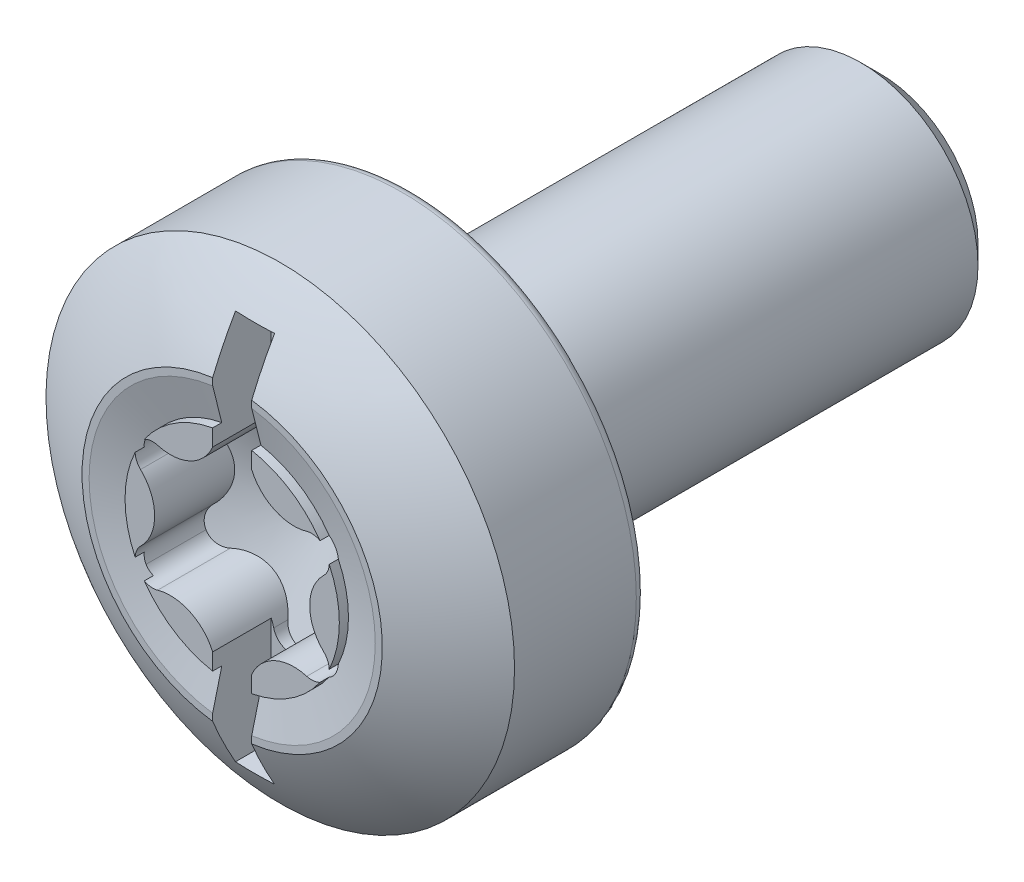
ISO-10303-21;
HEADER;
FILE_DESCRIPTION(('STEP AP214'),'2;1');
FILE_NAME('part.step','',(''),(''),'','','');
FILE_SCHEMA(('AUTOMOTIVE_DESIGN { 1 0 10303 214 1 1 1 1 }'));
ENDSEC;
DATA;
#1=APPLICATION_CONTEXT('core data for automotive mechanical design processes');
#2=APPLICATION_PROTOCOL_DEFINITION('international standard','automotive_design',2000,#1);
#3=PRODUCT_CONTEXT('',#1,'mechanical');
#4=PRODUCT('Part','Part','',(#3));
#5=PRODUCT_RELATED_PRODUCT_CATEGORY('part','',(#4));
#6=PRODUCT_DEFINITION_FORMATION('','',#4);
#7=PRODUCT_DEFINITION_CONTEXT('part definition',#1,'design');
#8=PRODUCT_DEFINITION('design','',#6,#7);
#9=PRODUCT_DEFINITION_SHAPE('','',#8);
#10=(LENGTH_UNIT() NAMED_UNIT(*) SI_UNIT(.MILLI.,.METRE.));
#11=(NAMED_UNIT(*) PLANE_ANGLE_UNIT() SI_UNIT($,.RADIAN.));
#12=(NAMED_UNIT(*) SI_UNIT($,.STERADIAN.) SOLID_ANGLE_UNIT());
#13=UNCERTAINTY_MEASURE_WITH_UNIT(LENGTH_MEASURE(1.E-05),#10,'distance_accuracy_value','');
#14=(GEOMETRIC_REPRESENTATION_CONTEXT(3) GLOBAL_UNCERTAINTY_ASSIGNED_CONTEXT((#13)) GLOBAL_UNIT_ASSIGNED_CONTEXT((#10,
#11,#12)) REPRESENTATION_CONTEXT('',''));
#15=CARTESIAN_POINT('',(0.,0.,0.));
#16=DIRECTION('',(0.,0.,1.));
#17=DIRECTION('',(1.,0.,0.));
#18=AXIS2_PLACEMENT_3D('',#15,#16,#17);
#19=CARTESIAN_POINT('',(0.,0.,4.6));
#20=DIRECTION('',(0.,0.,1.));
#21=DIRECTION('',(1.,0.,0.));
#22=AXIS2_PLACEMENT_3D('',#19,#20,#21);
#23=PLANE('',#22);
#24=DIRECTION('',(0.,1.,0.));
#25=VECTOR('',#24,1.);
#26=CARTESIAN_POINT('',(0.5,-5.,4.6));
#27=LINE('',#26,#25);
#28=CARTESIAN_POINT('',(0.5,-3.81232564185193,4.6));
#29=VERTEX_POINT('',#28);
#30=CARTESIAN_POINT('',(0.5,-3.62982478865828,4.6));
#31=VERTEX_POINT('',#30);
#32=EDGE_CURVE('E1208',#29,#31,#27,.T.);
#33=ORIENTED_EDGE('',*,*,#32,.F.);
#34=CARTESIAN_POINT('',(0.,0.,4.6));
#35=DIRECTION('',(0.,0.,1.));
#36=DIRECTION('',(1.,0.,0.));
#37=AXIS2_PLACEMENT_3D('',#34,#35,#36);
#38=CIRCLE('',#37,3.84497422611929);
#39=CARTESIAN_POINT('',(0.5,3.81232564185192,4.6));
#40=VERTEX_POINT('',#39);
#41=EDGE_CURVE('E1040',#29,#40,#38,.T.);
#42=ORIENTED_EDGE('',*,*,#41,.T.);
#43=CARTESIAN_POINT('',(0.5,3.62982478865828,4.6));
#44=VERTEX_POINT('',#43);
#45=EDGE_CURVE('E1210',#44,#40,#27,.T.);
#46=ORIENTED_EDGE('',*,*,#45,.F.);
#47=CARTESIAN_POINT('',(0.,0.,4.6));
#48=DIRECTION('',(0.,0.,1.));
#49=DIRECTION('',(1.,0.,0.));
#50=AXIS2_PLACEMENT_3D('',#47,#48,#49);
#51=CIRCLE('',#50,3.66409988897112);
#52=EDGE_CURVE('E491',#31,#44,#51,.T.);
#53=ORIENTED_EDGE('',*,*,#52,.F.);
#54=EDGE_LOOP('',(#33,#42,#46,#53));
#55=FACE_BOUND('',#54,.T.);
#56=ADVANCED_FACE('F32',(#55),#23,.T.);
#57=CARTESIAN_POINT('',(0.,-2.35,1.82688334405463));
#58=DIRECTION('',(0.,0.,1.));
#59=DIRECTION('',(1.,0.,0.));
#60=AXIS2_PLACEMENT_3D('',#57,#58,#59);
#61=CYLINDRICAL_SURFACE('',#60,0.45);
#62=DIRECTION('',(0.,0.,1.));
#63=VECTOR('',#62,1.);
#64=CARTESIAN_POINT('',(-0.43687036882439,-2.45790866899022,1.82688334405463));
#65=LINE('',#64,#63);
#66=CARTESIAN_POINT('',(-0.43687036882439,-2.45790866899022,2.7355101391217));
#67=VERTEX_POINT('',#66);
#68=CARTESIAN_POINT('',(-0.43687036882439,-2.45790866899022,3.1));
#69=VERTEX_POINT('',#68);
#70=EDGE_CURVE('E1159',#67,#69,#65,.T.);
#71=ORIENTED_EDGE('',*,*,#70,.T.);
#72=CARTESIAN_POINT('',(0.,-2.35,3.1));
#73=DIRECTION('',(0.,0.,1.));
#74=DIRECTION('',(1.,0.,0.));
#75=AXIS2_PLACEMENT_3D('',#72,#73,#74);
#76=CIRCLE('',#75,0.45);
#77=CARTESIAN_POINT('',(0.,-2.8,3.1));
#78=VERTEX_POINT('',#77);
#79=EDGE_CURVE('E1016',#69,#78,#76,.T.);
#80=ORIENTED_EDGE('',*,*,#79,.T.);
#81=DIRECTION('',(0.,0.,1.));
#82=VECTOR('',#81,1.);
#83=CARTESIAN_POINT('',(0.,-2.8,1.82688334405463));
#84=LINE('',#83,#82);
#85=CARTESIAN_POINT('',(0.,-2.8,2.846));
#86=VERTEX_POINT('',#85);
#87=EDGE_CURVE('E1154',#86,#78,#84,.T.);
#88=ORIENTED_EDGE('',*,*,#87,.F.);
#89=CARTESIAN_POINT('',(1.99999999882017E-07,-2.79999999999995,2.846));
#90=CARTESIAN_POINT('',(-0.0244832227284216,-2.80002494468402,2.84600541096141));
#91=CARTESIAN_POINT('',(-0.0489545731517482,-2.79800353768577,2.84539008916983));
#92=CARTESIAN_POINT('',(-0.0971585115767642,-2.79005670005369,2.84295934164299));
#93=CARTESIAN_POINT('',(-0.120892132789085,-2.78413701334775,2.84114568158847));
#94=CARTESIAN_POINT('',(-0.166983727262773,-2.7685806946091,2.83635921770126));
#95=CARTESIAN_POINT('',(-0.189341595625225,-2.75894377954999,2.8333863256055));
#96=CARTESIAN_POINT('',(-0.232078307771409,-2.73629534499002,2.82635659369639));
#97=CARTESIAN_POINT('',(-0.252457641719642,-2.72328466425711,2.82230002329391));
#98=CARTESIAN_POINT('',(-0.29105818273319,-2.69406511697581,2.81311957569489));
#99=CARTESIAN_POINT('',(-0.309237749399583,-2.67780655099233,2.80797903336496));
#100=CARTESIAN_POINT('',(-0.342632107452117,-2.64273006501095,2.79678504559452));
#101=CARTESIAN_POINT('',(-0.357843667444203,-2.62390939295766,2.79073061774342));
#102=CARTESIAN_POINT('',(-0.386699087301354,-2.58172400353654,2.77701286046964));
#103=CARTESIAN_POINT('',(-0.399893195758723,-2.55808599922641,2.76924278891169));
#104=CARTESIAN_POINT('',(-0.421802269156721,-2.50908774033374,2.75291585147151));
#105=CARTESIAN_POINT('',(-0.430520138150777,-2.48372861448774,2.74435949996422));
#106=CARTESIAN_POINT('',(-0.436870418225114,-2.45790846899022,2.73551007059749));
#107=B_SPLINE_CURVE_WITH_KNOTS('',3,(#89,#90,#91,#92,#93,#94,#95,#96,#97,#98,#99,#100,#101,#102,
#103,#104,#105,#106),.UNSPECIFIED.,.F.,.F.,(4,2,2,2,2,2,2,2,4),(0.,0.0733409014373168,
0.146573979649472,0.21981263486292,0.293033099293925,0.367474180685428,0.441995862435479,
0.526054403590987,0.610058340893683),.UNSPECIFIED.);
#108=EDGE_CURVE('E694',#86,#67,#107,.T.);
#109=ORIENTED_EDGE('',*,*,#108,.T.);
#110=EDGE_LOOP('',(#71,#80,#88,#109));
#111=FACE_BOUND('',#110,.T.);
#112=ADVANCED_FACE('F383',(#111),#61,.F.);
#113=CARTESIAN_POINT('',(0.,2.35,1.82688334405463));
#114=DIRECTION('',(0.,0.,1.));
#115=DIRECTION('',(1.,0.,0.));
#116=AXIS2_PLACEMENT_3D('',#113,#114,#115);
#117=CYLINDRICAL_SURFACE('',#116,0.45);
#118=DIRECTION('',(0.,0.,1.));
#119=VECTOR('',#118,1.);
#120=CARTESIAN_POINT('',(0.,2.8,1.82688334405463));
#121=LINE('',#120,#119);
#122=CARTESIAN_POINT('',(0.,2.8,2.846));
#123=VERTEX_POINT('',#122);
#124=CARTESIAN_POINT('',(0.,2.8,3.1));
#125=VERTEX_POINT('',#124);
#126=EDGE_CURVE('E1028',#123,#125,#121,.T.);
#127=ORIENTED_EDGE('',*,*,#126,.T.);
#128=CARTESIAN_POINT('',(0.,2.35,3.1));
#129=DIRECTION('',(0.,0.,1.));
#130=DIRECTION('',(1.,0.,0.));
#131=AXIS2_PLACEMENT_3D('',#128,#129,#130);
#132=CIRCLE('',#131,0.45);
#133=CARTESIAN_POINT('',(-0.436870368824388,2.45790866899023,3.1));
#134=VERTEX_POINT('',#133);
#135=EDGE_CURVE('E526',#125,#134,#132,.T.);
#136=ORIENTED_EDGE('',*,*,#135,.T.);
#137=DIRECTION('',(0.,0.,1.));
#138=VECTOR('',#137,1.);
#139=CARTESIAN_POINT('',(-0.436870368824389,2.45790866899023,1.82688334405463));
#140=LINE('',#139,#138);
#141=CARTESIAN_POINT('',(-0.436870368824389,2.45790866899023,2.7355101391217));
#142=VERTEX_POINT('',#141);
#143=EDGE_CURVE('E524',#142,#134,#140,.T.);
#144=ORIENTED_EDGE('',*,*,#143,.F.);
#145=CARTESIAN_POINT('',(-0.436870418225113,2.45790846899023,2.73551007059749));
#146=CARTESIAN_POINT('',(-0.430764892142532,2.48271273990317,2.74401098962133));
#147=CARTESIAN_POINT('',(-0.42248304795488,2.50708694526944,2.75224032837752));
#148=CARTESIAN_POINT('',(-0.401772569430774,2.55430295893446,2.76798989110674));
#149=CARTESIAN_POINT('',(-0.389336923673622,2.57714209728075,2.7755088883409));
#150=CARTESIAN_POINT('',(-0.360524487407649,2.62056049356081,2.78965275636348));
#151=CARTESIAN_POINT('',(-0.344141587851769,2.64113617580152,2.7962762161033));
#152=CARTESIAN_POINT('',(-0.307862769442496,2.67925911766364,2.80844276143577));
#153=CARTESIAN_POINT('',(-0.287970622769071,2.69680958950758,2.81398699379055));
#154=CARTESIAN_POINT('',(-0.24601251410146,2.72766468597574,2.82366984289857));
#155=CARTESIAN_POINT('',(-0.224055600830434,2.74110349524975,2.82785325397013));
#156=CARTESIAN_POINT('',(-0.178001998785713,2.76409814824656,2.83497952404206));
#157=CARTESIAN_POINT('',(-0.153905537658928,2.77365440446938,2.83792251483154));
#158=CARTESIAN_POINT('',(-0.108260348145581,2.78732527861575,2.84212270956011));
#159=CARTESIAN_POINT('',(-0.0869135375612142,2.79206249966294,2.84357323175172));
#160=CARTESIAN_POINT('',(-0.0437152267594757,2.79840711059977,2.84551339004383));
#161=CARTESIAN_POINT('',(-0.0218636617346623,2.80001409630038,2.84600290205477));
#162=CARTESIAN_POINT('',(2.00000000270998E-07,2.79999999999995,2.846));
#163=B_SPLINE_CURVE_WITH_KNOTS('',3,(#145,#146,#147,#148,#149,#150,#151,#152,#153,#154,#155,
#156,#157,#158,#159,#160,#161,#162),.UNSPECIFIED.,.F.,.F.,(4,2,2,2,2,2,2,2,4),(0.,
0.0806957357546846,0.161528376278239,0.242486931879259,0.323358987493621,0.401208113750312,
0.479048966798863,0.544546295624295,0.61005208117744),.UNSPECIFIED.);
#164=EDGE_CURVE('E650',#142,#123,#163,.T.);
#165=ORIENTED_EDGE('',*,*,#164,.T.);
#166=EDGE_LOOP('',(#127,#136,#144,#165));
#167=FACE_BOUND('',#166,.T.);
#168=ADVANCED_FACE('F389',(#167),#117,.F.);
#169=CARTESIAN_POINT('',(0.,2.35,1.82688334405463));
#170=DIRECTION('',(0.,0.,1.));
#171=DIRECTION('',(1.,0.,0.));
#172=AXIS2_PLACEMENT_3D('',#169,#170,#171);
#173=CYLINDRICAL_SURFACE('',#172,0.45);
#174=DIRECTION('',(0.,0.,1.));
#175=VECTOR('',#174,1.);
#176=CARTESIAN_POINT('',(0.43687036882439,2.45790866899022,1.82688334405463));
#177=LINE('',#176,#175);
#178=CARTESIAN_POINT('',(0.43687036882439,2.45790866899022,2.7355101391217));
#179=VERTEX_POINT('',#178);
#180=CARTESIAN_POINT('',(0.436870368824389,2.45790866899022,3.1));
#181=VERTEX_POINT('',#180);
#182=EDGE_CURVE('E1031',#179,#181,#177,.T.);
#183=ORIENTED_EDGE('',*,*,#182,.T.);
#184=CARTESIAN_POINT('',(0.,2.35,3.1));
#185=DIRECTION('',(0.,0.,1.));
#186=DIRECTION('',(1.,0.,0.));
#187=AXIS2_PLACEMENT_3D('',#184,#185,#186);
#188=CIRCLE('',#187,0.45);
#189=EDGE_CURVE('E531',#181,#125,#188,.T.);
#190=ORIENTED_EDGE('',*,*,#189,.T.);
#191=ORIENTED_EDGE('',*,*,#126,.F.);
#192=CARTESIAN_POINT('',(-2.00000000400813E-07,2.79999999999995,2.846));
#193=CARTESIAN_POINT('',(0.0244832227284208,2.80002494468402,2.84600541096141));
#194=CARTESIAN_POINT('',(0.0489545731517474,2.79800353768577,2.84539008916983));
#195=CARTESIAN_POINT('',(0.0971585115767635,2.79005670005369,2.84295934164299));
#196=CARTESIAN_POINT('',(0.120892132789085,2.78413701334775,2.84114568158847));
#197=CARTESIAN_POINT('',(0.166983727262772,2.7685806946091,2.83635921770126));
#198=CARTESIAN_POINT('',(0.189341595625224,2.75894377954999,2.8333863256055));
#199=CARTESIAN_POINT('',(0.232078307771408,2.73629534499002,2.82635659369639));
#200=CARTESIAN_POINT('',(0.252457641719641,2.72328466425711,2.82230002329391));
#201=CARTESIAN_POINT('',(0.29105818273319,2.69406511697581,2.8131195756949));
#202=CARTESIAN_POINT('',(0.309237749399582,2.67780655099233,2.80797903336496));
#203=CARTESIAN_POINT('',(0.342632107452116,2.64273006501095,2.79678504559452));
#204=CARTESIAN_POINT('',(0.357843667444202,2.62390939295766,2.79073061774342));
#205=CARTESIAN_POINT('',(0.386699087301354,2.58172400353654,2.77701286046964));
#206=CARTESIAN_POINT('',(0.399893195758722,2.55808599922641,2.76924278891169));
#207=CARTESIAN_POINT('',(0.42180226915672,2.50908774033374,2.75291585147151));
#208=CARTESIAN_POINT('',(0.430520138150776,2.48372861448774,2.74435949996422));
#209=CARTESIAN_POINT('',(0.436870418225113,2.45790846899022,2.73551007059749));
#210=B_SPLINE_CURVE_WITH_KNOTS('',3,(#192,#193,#194,#195,#196,#197,#198,#199,#200,#201,#202,
#203,#204,#205,#206,#207,#208,#209),.UNSPECIFIED.,.F.,.F.,(4,2,2,2,2,2,2,2,4),(0.,
0.0733409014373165,0.146573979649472,0.219812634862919,0.293033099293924,0.367474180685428,
0.441995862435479,0.526054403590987,0.610058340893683),.UNSPECIFIED.);
#211=EDGE_CURVE('E642',#123,#179,#210,.T.);
#212=ORIENTED_EDGE('',*,*,#211,.T.);
#213=EDGE_LOOP('',(#183,#190,#191,#212));
#214=FACE_BOUND('',#213,.T.);
#215=ADVANCED_FACE('F1026',(#214),#173,.F.);
#216=CARTESIAN_POINT('',(0.,-2.35,1.82688334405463));
#217=DIRECTION('',(0.,0.,1.));
#218=DIRECTION('',(1.,0.,0.));
#219=AXIS2_PLACEMENT_3D('',#216,#217,#218);
#220=CYLINDRICAL_SURFACE('',#219,0.45);
#221=ORIENTED_EDGE('',*,*,#87,.T.);
#222=CARTESIAN_POINT('',(0.,-2.35,3.1));
#223=DIRECTION('',(0.,0.,1.));
#224=DIRECTION('',(1.,0.,0.));
#225=AXIS2_PLACEMENT_3D('',#222,#223,#224);
#226=CIRCLE('',#225,0.45);
#227=CARTESIAN_POINT('',(0.436870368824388,-2.45790866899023,3.1));
#228=VERTEX_POINT('',#227);
#229=EDGE_CURVE('E501',#78,#228,#226,.T.);
#230=ORIENTED_EDGE('',*,*,#229,.T.);
#231=DIRECTION('',(0.,0.,1.));
#232=VECTOR('',#231,1.);
#233=CARTESIAN_POINT('',(0.436870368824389,-2.45790866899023,1.82688334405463));
#234=LINE('',#233,#232);
#235=CARTESIAN_POINT('',(0.436870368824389,-2.45790866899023,2.7355101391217));
#236=VERTEX_POINT('',#235);
#237=EDGE_CURVE('E1187',#236,#228,#234,.T.);
#238=ORIENTED_EDGE('',*,*,#237,.F.);
#239=CARTESIAN_POINT('',(0.436870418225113,-2.45790846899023,2.73551007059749));
#240=CARTESIAN_POINT('',(0.430764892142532,-2.48271273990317,2.74401098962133));
#241=CARTESIAN_POINT('',(0.42248304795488,-2.50708694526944,2.75224032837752));
#242=CARTESIAN_POINT('',(0.401772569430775,-2.55430295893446,2.76798989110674));
#243=CARTESIAN_POINT('',(0.389336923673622,-2.57714209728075,2.7755088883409));
#244=CARTESIAN_POINT('',(0.360524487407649,-2.62056049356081,2.78965275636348));
#245=CARTESIAN_POINT('',(0.344141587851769,-2.64113617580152,2.7962762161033));
#246=CARTESIAN_POINT('',(0.307862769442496,-2.67925911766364,2.80844276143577));
#247=CARTESIAN_POINT('',(0.287970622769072,-2.69680958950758,2.81398699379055));
#248=CARTESIAN_POINT('',(0.24601251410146,-2.72766468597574,2.82366984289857));
#249=CARTESIAN_POINT('',(0.224055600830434,-2.74110349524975,2.82785325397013));
#250=CARTESIAN_POINT('',(0.178001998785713,-2.76409814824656,2.83497952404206));
#251=CARTESIAN_POINT('',(0.153905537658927,-2.77365440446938,2.83792251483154));
#252=CARTESIAN_POINT('',(0.108260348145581,-2.78732527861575,2.84212270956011));
#253=CARTESIAN_POINT('',(0.0869135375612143,-2.79206249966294,2.84357323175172));
#254=CARTESIAN_POINT('',(0.0437152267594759,-2.79840711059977,2.84551339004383));
#255=CARTESIAN_POINT('',(0.0218636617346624,-2.80001409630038,2.84600290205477));
#256=CARTESIAN_POINT('',(-2.00000000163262E-07,-2.79999999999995,2.846));
#257=B_SPLINE_CURVE_WITH_KNOTS('',3,(#239,#240,#241,#242,#243,#244,#245,#246,#247,#248,#249,
#250,#251,#252,#253,#254,#255,#256),.UNSPECIFIED.,.F.,.F.,(4,2,2,2,2,2,2,2,4),(0.,
0.0806957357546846,0.161528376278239,0.242486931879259,0.323358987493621,0.401208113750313,
0.479048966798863,0.544546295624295,0.61005208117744),.UNSPECIFIED.);
#258=EDGE_CURVE('E615',#236,#86,#257,.T.);
#259=ORIENTED_EDGE('',*,*,#258,.T.);
#260=EDGE_LOOP('',(#221,#230,#238,#259));
#261=FACE_BOUND('',#260,.T.);
#262=ADVANCED_FACE('F611',(#261),#220,.F.);
#263=CARTESIAN_POINT('',(0.,0.,4.646));
#264=DIRECTION('',(0.,0.,1.));
#265=DIRECTION('',(1.,0.,0.));
#266=AXIS2_PLACEMENT_3D('',#263,#264,#265);
#267=CONICAL_SURFACE('',#266,3.84497422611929,1.32175573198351);
#268=ORIENTED_EDGE('',*,*,#52,.T.);
#269=CARTESIAN_POINT('',(0.5,4.69350855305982,4.86855351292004));
#270=CARTESIAN_POINT('',(0.5,4.50054304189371,4.81975845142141));
#271=CARTESIAN_POINT('',(0.5,4.30757122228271,4.77098828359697));
#272=CARTESIAN_POINT('',(0.5,3.9213680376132,4.67348413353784));
#273=CARTESIAN_POINT('',(0.5,3.72813664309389,4.62475026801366));
#274=CARTESIAN_POINT('',(0.5,3.33538407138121,4.52584953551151));
#275=CARTESIAN_POINT('',(0.5,3.13586171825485,4.47568733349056));
#276=CARTESIAN_POINT('',(0.5,2.73699826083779,4.37568779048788));
#277=CARTESIAN_POINT('',(0.5,2.53765723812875,4.32585012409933));
#278=CARTESIAN_POINT('',(0.5,2.14537764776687,4.22828176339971));
#279=CARTESIAN_POINT('',(0.5,1.95244297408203,4.18053547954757));
#280=CARTESIAN_POINT('',(0.5,1.66247771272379,4.10960552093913));
#281=CARTESIAN_POINT('',(0.5,1.56554260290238,4.08603264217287));
#282=CARTESIAN_POINT('',(0.5,1.37159975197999,4.03933972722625));
#283=CARTESIAN_POINT('',(0.5,1.27459204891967,4.01621953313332));
#284=CARTESIAN_POINT('',(0.5,1.08269966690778,3.97129107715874));
#285=CARTESIAN_POINT('',(0.5,0.987819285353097,3.94946469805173));
#286=CARTESIAN_POINT('',(0.5,0.845183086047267,3.91782114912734));
#287=CARTESIAN_POINT('',(0.5,0.797550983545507,3.90744896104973));
#288=CARTESIAN_POINT('',(0.5,0.702168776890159,3.88726469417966));
#289=CARTESIAN_POINT('',(0.5,0.654418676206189,3.87745259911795));
#290=CARTESIAN_POINT('',(0.5,0.559105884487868,3.85874735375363));
#291=CARTESIAN_POINT('',(0.5,0.511544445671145,3.84984790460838));
#292=CARTESIAN_POINT('',(0.5,0.416182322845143,3.83335240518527));
#293=CARTESIAN_POINT('',(0.5,0.368381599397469,3.8257565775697));
#294=CARTESIAN_POINT('',(0.5,0.272612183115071,3.81261608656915));
#295=CARTESIAN_POINT('',(0.5,0.224644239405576,3.8070661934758));
#296=CARTESIAN_POINT('',(0.5,0.128466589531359,3.79893429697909));
#297=CARTESIAN_POINT('',(0.5,0.0802570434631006,3.79635053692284));
#298=CARTESIAN_POINT('',(0.5,-0.0106301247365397,3.794872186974));
#299=CARTESIAN_POINT('',(0.5,-0.0533011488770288,3.79558464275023));
#300=CARTESIAN_POINT('',(0.5,-0.138546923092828,3.7996641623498));
#301=CARTESIAN_POINT('',(0.5,-0.181121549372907,3.80303365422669));
#302=CARTESIAN_POINT('',(0.5,-0.266156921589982,3.81185758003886));
#303=CARTESIAN_POINT('',(0.5,-0.308617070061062,3.81731749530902));
#304=CARTESIAN_POINT('',(0.5,-0.393317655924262,3.82969298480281));
#305=CARTESIAN_POINT('',(0.5,-0.435558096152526,3.83660854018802));
#306=CARTESIAN_POINT('',(0.5,-0.519515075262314,3.8513587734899));
#307=CARTESIAN_POINT('',(0.5,-0.561233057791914,3.85918537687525));
#308=CARTESIAN_POINT('',(0.5,-0.644541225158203,3.87549542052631));
#309=CARTESIAN_POINT('',(0.5,-0.686131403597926,3.88397889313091));
#310=CARTESIAN_POINT('',(0.5,-0.810776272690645,3.91009846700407));
#311=CARTESIAN_POINT('',(0.5,-0.893690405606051,3.92840093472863));
#312=CARTESIAN_POINT('',(0.5,-1.05934466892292,3.96590943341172));
#313=CARTESIAN_POINT('',(0.5,-1.14208471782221,3.98511581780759));
#314=CARTESIAN_POINT('',(0.5,-1.30743277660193,4.02404942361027));
#315=CARTESIAN_POINT('',(0.5,-1.3900407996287,4.04377658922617));
#316=CARTESIAN_POINT('',(0.5,-1.6378896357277,4.10345682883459));
#317=CARTESIAN_POINT('',(0.5,-1.80301762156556,4.14387660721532));
#318=CARTESIAN_POINT('',(0.5,-2.13310475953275,4.22525035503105));
#319=CARTESIAN_POINT('',(0.5,-2.2980639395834,4.26620421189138));
#320=CARTESIAN_POINT('',(0.5,-2.52448358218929,4.32263686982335));
#321=CARTESIAN_POINT('',(0.5,-2.58597645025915,4.33798561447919));
#322=CARTESIAN_POINT('',(0.5,-2.70895566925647,4.36871834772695));
#323=CARTESIAN_POINT('',(0.5,-2.77044201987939,4.38410233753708));
#324=CARTESIAN_POINT('',(0.5,-2.95483387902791,4.43028267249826));
#325=CARTESIAN_POINT('',(0.5,-3.077728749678,4.46112149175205));
#326=CARTESIAN_POINT('',(0.5,-3.46635420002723,4.55877111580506));
#327=CARTESIAN_POINT('',(0.5,-3.73204924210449,4.62572329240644));
#328=CARTESIAN_POINT('',(0.5,-4.26339410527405,4.75981259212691));
#329=CARTESIAN_POINT('',(0.5,-4.52904392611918,4.82694971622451));
#330=CARTESIAN_POINT('',(0.5,-5.06066676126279,4.961422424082));
#331=CARTESIAN_POINT('',(0.5,-5.32663973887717,5.02875815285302));
#332=CARTESIAN_POINT('',(0.5,-5.85856566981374,5.16350231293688));
#333=CARTESIAN_POINT('',(0.5,-6.12451862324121,5.23091074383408));
#334=CARTESIAN_POINT('',(0.5,-6.3904669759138,5.29833727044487));
#335=B_SPLINE_CURVE_WITH_KNOTS('',3,(#269,#270,#271,#272,#273,#274,#275,#276,#277,#278,#279,
#280,#281,#282,#283,#284,#285,#286,#287,#288,#289,#290,#291,#292,#293,#294,#295,#296,#297,#298,
#299,#300,#301,#302,#303,#304,#305,#306,#307,#308,#309,#310,#311,#312,#313,#314,#315,#316,#317,
#318,#319,#320,#321,#322,#323,#324,#325,#326,#327,#328,#329,#330,#331,#332,#333,#334),
.UNSPECIFIED.,.F.,.F.,(4,2,2,2,2,2,2,2,2,2,2,2,2,2,2,2,2,2,2,2,2,2,2,2,2,2,2,2,2,2,2,2,4),(0.,
0.597117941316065,1.1949642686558,1.81215838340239,2.42858807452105,3.02485114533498,
3.32413097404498,3.62330447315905,3.91537250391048,4.06161535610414,4.20785395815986,
4.35300359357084,4.49817799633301,4.64297869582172,4.78769359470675,4.9156319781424,
5.04368740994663,5.17208094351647,5.300472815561,5.42780283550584,5.55513912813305,
5.80985715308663,6.06467561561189,6.31946688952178,6.82947324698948,7.33937378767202,
7.52951217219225,7.71965723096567,8.09977248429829,8.92177478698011,9.74378144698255,
10.5668740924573,11.3899620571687),.UNSPECIFIED.);
#336=CARTESIAN_POINT('',(0.5,2.69806152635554,4.366));
#337=VERTEX_POINT('',#336);
#338=EDGE_CURVE('E355',#44,#337,#335,.T.);
#339=ORIENTED_EDGE('',*,*,#338,.T.);
#340=CARTESIAN_POINT('',(0.,0.,4.366));
#341=DIRECTION('',(0.,0.,1.));
#342=DIRECTION('',(1.,0.,0.));
#343=AXIS2_PLACEMENT_3D('',#340,#341,#342);
#344=CIRCLE('',#343,2.744);
#345=CARTESIAN_POINT('',(2.2503115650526,1.57023369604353,4.366));
#346=VERTEX_POINT('',#345);
#347=EDGE_CURVE('E538',#346,#337,#344,.T.);
#348=ORIENTED_EDGE('',*,*,#347,.F.);
#349=CARTESIAN_POINT('',(2.25031001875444,1.57023453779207,4.3659998));
#350=CARTESIAN_POINT('',(2.27228998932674,1.55830081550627,4.36884474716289));
#351=CARTESIAN_POINT('',(2.29329799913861,1.54446095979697,4.3712840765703));
#352=CARTESIAN_POINT('',(2.33232500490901,1.51380349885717,4.37526592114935));
#353=CARTESIAN_POINT('',(2.35040168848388,1.49706179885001,4.37682779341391));
#354=CARTESIAN_POINT('',(2.37794631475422,1.46699577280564,4.37871658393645));
#355=CARTESIAN_POINT('',(2.38825205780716,1.45444381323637,4.37928281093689));
#356=CARTESIAN_POINT('',(2.40760530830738,1.42809230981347,4.38004847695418));
#357=CARTESIAN_POINT('',(2.41663079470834,1.41427642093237,4.3802420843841));
#358=CARTESIAN_POINT('',(2.42487133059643,1.39999965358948,4.38024193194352));
#359=B_SPLINE_CURVE_WITH_KNOTS('',3,(#349,#350,#351,#352,#353,#354,#355,#356,#357,#358),
.UNSPECIFIED.,.F.,.F.,(4,2,2,2,4),(0.,0.0754471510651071,0.149157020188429,0.197815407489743,
0.247229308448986),.UNSPECIFIED.);
#360=CARTESIAN_POINT('',(2.42487113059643,1.4,4.38024193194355));
#361=VERTEX_POINT('',#360);
#362=EDGE_CURVE('E1092',#346,#361,#359,.T.);
#363=ORIENTED_EDGE('',*,*,#362,.T.);
#364=CARTESIAN_POINT('',(2.42487101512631,1.4000002,4.38024193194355));
#365=CARTESIAN_POINT('',(2.43748168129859,1.37821313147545,4.38024613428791));
#366=CARTESIAN_POINT('',(2.44821803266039,1.35534062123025,4.37979140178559));
#367=CARTESIAN_POINT('',(2.46553336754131,1.30870252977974,4.37801225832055));
#368=CARTESIAN_POINT('',(2.47220218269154,1.28496953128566,4.376708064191));
#369=CARTESIAN_POINT('',(2.4799787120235,1.24499791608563,4.37385843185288));
#370=CARTESIAN_POINT('',(2.48220596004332,1.22895201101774,4.37254542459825));
#371=CARTESIAN_POINT('',(2.48494546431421,1.19649584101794,4.36954932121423));
#372=CARTESIAN_POINT('',(2.48543061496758,1.18008378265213,4.36786080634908));
#373=CARTESIAN_POINT('',(2.48501800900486,1.16370837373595,4.3659998));
#374=B_SPLINE_CURVE_WITH_KNOTS('',3,(#364,#365,#366,#367,#368,#369,#370,#371,#372,#373),
.UNSPECIFIED.,.F.,.F.,(4,2,2,2,4),(0.,0.0754358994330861,0.14913900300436,0.197806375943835,
0.247227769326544),.UNSPECIFIED.);
#375=CARTESIAN_POINT('',(2.48501805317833,1.16371013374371,4.366));
#376=VERTEX_POINT('',#375);
#377=EDGE_CURVE('E1112',#361,#376,#374,.T.);
#378=ORIENTED_EDGE('',*,*,#377,.T.);
#379=CARTESIAN_POINT('',(2.48501805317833,-1.16371013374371,4.366));
#380=VERTEX_POINT('',#379);
#381=EDGE_CURVE('E529',#380,#376,#344,.T.);
#382=ORIENTED_EDGE('',*,*,#381,.F.);
#383=CARTESIAN_POINT('',(2.48501800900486,-1.16370837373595,4.3659998));
#384=CARTESIAN_POINT('',(2.48567308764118,-1.18871044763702,4.36884474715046));
#385=CARTESIAN_POINT('',(2.48419142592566,-1.21382384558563,4.37128407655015));
#386=CARTESIAN_POINT('',(2.47715478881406,-1.26295095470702,4.37526592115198));
#387=CARTESIAN_POINT('',(2.47169439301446,-1.28697667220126,4.37682779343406));
#388=CARTESIAN_POINT('',(2.45942877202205,-1.32586400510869,4.37871658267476));
#389=CARTESIAN_POINT('',(2.45371133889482,-1.34106499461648,4.37928280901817));
#390=CARTESIAN_POINT('',(2.44056692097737,-1.37100110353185,4.38004847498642));
#391=CARTESIAN_POINT('',(2.43311477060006,-1.38572532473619,4.38024208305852));
#392=CARTESIAN_POINT('',(2.42487101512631,-1.4000002,4.38024193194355));
#393=B_SPLINE_CURVE_WITH_KNOTS('',3,(#383,#384,#385,#386,#387,#388,#389,#390,#391,#392),
.UNSPECIFIED.,.F.,.F.,(4,2,2,2,4),(0.,0.0754471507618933,0.149157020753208,0.197815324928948,
0.24722913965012),.UNSPECIFIED.);
#394=CARTESIAN_POINT('',(2.42487113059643,-1.4,4.38024193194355));
#395=VERTEX_POINT('',#394);
#396=EDGE_CURVE('E562',#380,#395,#393,.T.);
#397=ORIENTED_EDGE('',*,*,#396,.T.);
#398=CARTESIAN_POINT('',(2.42487133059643,-1.39999965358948,4.38024193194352));
#399=CARTESIAN_POINT('',(2.41230851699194,-1.42181434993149,4.38024613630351));
#400=CARTESIAN_POINT('',(2.39786852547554,-1.44254856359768,4.37979140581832));
#401=CARTESIAN_POINT('',(2.36613643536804,-1.48086314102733,4.37801226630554));
#402=CARTESIAN_POINT('',(2.3489174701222,-1.49850500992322,4.37670807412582));
#403=CARTESIAN_POINT('',(2.31818928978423,-1.52522551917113,4.37385844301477));
#404=CARTESIAN_POINT('',(2.30540673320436,-1.53517734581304,4.37254543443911));
#405=CARTESIAN_POINT('',(2.27866857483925,-1.55377794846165,4.36954932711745));
#406=CARTESIAN_POINT('',(2.26469786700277,-1.56240414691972,4.36786080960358));
#407=CARTESIAN_POINT('',(2.25031001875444,-1.57023453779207,4.3659998));
#408=B_SPLINE_CURVE_WITH_KNOTS('',3,(#398,#399,#400,#401,#402,#403,#404,#405,#406,#407),
.UNSPECIFIED.,.F.,.F.,(4,2,2,2,4),(0.,0.0754358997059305,0.149139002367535,0.197806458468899,
0.247227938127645),.UNSPECIFIED.);
#409=CARTESIAN_POINT('',(2.2503115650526,-1.57023369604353,4.366));
#410=VERTEX_POINT('',#409);
#411=EDGE_CURVE('E554',#395,#410,#408,.T.);
#412=ORIENTED_EDGE('',*,*,#411,.T.);
#413=CARTESIAN_POINT('',(0.5,-2.69806152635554,4.366));
#414=VERTEX_POINT('',#413);
#415=EDGE_CURVE('E536',#414,#410,#344,.T.);
#416=ORIENTED_EDGE('',*,*,#415,.F.);
#417=EDGE_CURVE('E345',#414,#31,#335,.T.);
#418=ORIENTED_EDGE('',*,*,#417,.T.);
#419=EDGE_LOOP('',(#268,#339,#348,#363,#378,#382,#397,#412,#416,#418));
#420=FACE_BOUND('',#419,.T.);
#421=ADVANCED_FACE('F395',(#420),#267,.F.);
#422=DIRECTION('',(0.,-1.,0.));
#423=VECTOR('',#422,1.);
#424=CARTESIAN_POINT('',(-0.5,-5.,4.6));
#425=LINE('',#424,#423);
#426=CARTESIAN_POINT('',(-0.5,3.81232564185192,4.6));
#427=VERTEX_POINT('',#426);
#428=CARTESIAN_POINT('',(-0.5,3.62982478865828,4.6));
#429=VERTEX_POINT('',#428);
#430=EDGE_CURVE('E313',#427,#429,#425,.T.);
#431=ORIENTED_EDGE('',*,*,#430,.F.);
#432=CARTESIAN_POINT('',(-0.5,-3.81232564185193,4.6));
#433=VERTEX_POINT('',#432);
#434=EDGE_CURVE('E1042',#427,#433,#38,.T.);
#435=ORIENTED_EDGE('',*,*,#434,.T.);
#436=CARTESIAN_POINT('',(-0.5,-3.62982478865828,4.6));
#437=VERTEX_POINT('',#436);
#438=EDGE_CURVE('E1052',#437,#433,#425,.T.);
#439=ORIENTED_EDGE('',*,*,#438,.F.);
#440=EDGE_CURVE('E494',#429,#437,#51,.T.);
#441=ORIENTED_EDGE('',*,*,#440,.F.);
#442=EDGE_LOOP('',(#431,#435,#439,#441));
#443=FACE_BOUND('',#442,.T.);
#444=ADVANCED_FACE('F385',(#443),#23,.T.);
#445=CARTESIAN_POINT('',(0.,3.75,0.));
#446=DIRECTION('',(0.,0.,1.));
#447=DIRECTION('',(1.,0.,0.));
#448=AXIS2_PLACEMENT_3D('',#445,#446,#447);
#449=PLANE('',#448);
#450=CARTESIAN_POINT('',(0.,0.,0.));
#451=DIRECTION('',(0.,0.,1.));
#452=DIRECTION('',(1.,0.,0.));
#453=AXIS2_PLACEMENT_3D('',#450,#451,#452);
#454=CIRCLE('',#453,5.75);
#455=CARTESIAN_POINT('',(5.75,0.,0.));
#456=VERTEX_POINT('',#455);
#457=EDGE_CURVE('E436',#456,#456,#454,.T.);
#458=ORIENTED_EDGE('',*,*,#457,.F.);
#459=EDGE_LOOP('',(#458));
#460=FACE_BOUND('',#459,.T.);
#461=CARTESIAN_POINT('',(0.,0.,0.));
#462=DIRECTION('',(0.,0.,-1.));
#463=DIRECTION('',(-1.,0.,0.));
#464=AXIS2_PLACEMENT_3D('',#461,#462,#463);
#465=CIRCLE('',#464,3.);
#466=CARTESIAN_POINT('',(-3.,0.,0.));
#467=VERTEX_POINT('',#466);
#468=EDGE_CURVE('E525',#467,#467,#465,.T.);
#469=ORIENTED_EDGE('',*,*,#468,.F.);
#470=EDGE_LOOP('',(#469));
#471=FACE_BOUND('',#470,.T.);
#472=ADVANCED_FACE('F394',(#460,#471),#449,.F.);
#473=CARTESIAN_POINT('',(0.,0.,0.25));
#474=DIRECTION('',(0.,0.,1.));
#475=DIRECTION('',(1.,0.,0.));
#476=AXIS2_PLACEMENT_3D('',#473,#474,#475);
#477=TOROIDAL_SURFACE('',#476,5.75,0.25);
#478=CARTESIAN_POINT('',(0.,0.,0.25));
#479=DIRECTION('',(0.,0.,1.));
#480=DIRECTION('',(1.,0.,0.));
#481=AXIS2_PLACEMENT_3D('',#478,#479,#480);
#482=CIRCLE('',#481,6.);
#483=CARTESIAN_POINT('',(6.,0.,0.25));
#484=VERTEX_POINT('',#483);
#485=EDGE_CURVE('E441',#484,#484,#482,.T.);
#486=ORIENTED_EDGE('',*,*,#485,.F.);
#487=EDGE_LOOP('',(#486));
#488=FACE_BOUND('',#487,.T.);
#489=ORIENTED_EDGE('',*,*,#457,.T.);
#490=EDGE_LOOP('',(#489));
#491=FACE_BOUND('',#490,.T.);
#492=ADVANCED_FACE('F715',(#488,#491),#477,.T.);
#493=CARTESIAN_POINT('',(0.,0.,0.));
#494=DIRECTION('',(0.,0.,1.));
#495=DIRECTION('',(1.,0.,0.));
#496=AXIS2_PLACEMENT_3D('',#493,#494,#495);
#497=CYLINDRICAL_SURFACE('',#496,6.);
#498=CARTESIAN_POINT('',(0.,0.,3.36873934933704));
#499=DIRECTION('',(0.,0.,1.));
#500=DIRECTION('',(1.,0.,0.));
#501=AXIS2_PLACEMENT_3D('',#498,#499,#500);
#502=CIRCLE('',#501,6.);
#503=CARTESIAN_POINT('',(6.,0.,3.36873934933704));
#504=VERTEX_POINT('',#503);
#505=EDGE_CURVE('E1043',#504,#504,#502,.T.);
#506=ORIENTED_EDGE('',*,*,#505,.F.);
#507=EDGE_LOOP('',(#506));
#508=FACE_BOUND('',#507,.T.);
#509=ORIENTED_EDGE('',*,*,#485,.T.);
#510=EDGE_LOOP('',(#509));
#511=FACE_BOUND('',#510,.T.);
#512=ADVANCED_FACE('F712',(#508,#511),#497,.T.);
#513=CARTESIAN_POINT('',(0.,0.,-4.63126065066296));
#514=DIRECTION('',(0.,0.,1.));
#515=DIRECTION('',(0.,1.,0.));
#516=AXIS2_PLACEMENT_3D('',#513,#514,#515);
#517=SPHERICAL_SURFACE('',#516,10.);
#518=ORIENTED_EDGE('',*,*,#41,.F.);
#519=CARTESIAN_POINT('',(0.5,0.,-4.63126065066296));
#520=DIRECTION('',(1.,0.,0.));
#521=DIRECTION('',(0.,0.,-1.));
#522=AXIS2_PLACEMENT_3D('',#519,#520,#521);
#523=CIRCLE('',#522,9.98749217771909);
#524=CARTESIAN_POINT('',(0.5,-5.,4.01454758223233));
#525=VERTEX_POINT('',#524);
#526=EDGE_CURVE('E1097',#29,#525,#523,.T.);
#527=ORIENTED_EDGE('',*,*,#526,.T.);
#528=CARTESIAN_POINT('',(0.,-5.,-4.63126065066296));
#529=DIRECTION('',(0.,-1.,0.));
#530=DIRECTION('',(0.,0.,-1.));
#531=AXIS2_PLACEMENT_3D('',#528,#529,#530);
#532=CIRCLE('',#531,8.66025403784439);
#533=CARTESIAN_POINT('',(-0.5,-5.,4.01454758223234));
#534=VERTEX_POINT('',#533);
#535=EDGE_CURVE('E11',#525,#534,#532,.T.);
#536=ORIENTED_EDGE('',*,*,#535,.T.);
#537=CARTESIAN_POINT('',(-0.5,0.,-4.63126065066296));
#538=DIRECTION('',(-1.,0.,0.));
#539=DIRECTION('',(0.,-1.,0.));
#540=AXIS2_PLACEMENT_3D('',#537,#538,#539);
#541=CIRCLE('',#540,9.98749217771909);
#542=EDGE_CURVE('E1013',#534,#433,#541,.T.);
#543=ORIENTED_EDGE('',*,*,#542,.T.);
#544=ORIENTED_EDGE('',*,*,#434,.F.);
#545=CARTESIAN_POINT('',(-0.5,5.,4.01454758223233));
#546=VERTEX_POINT('',#545);
#547=EDGE_CURVE('E510',#427,#546,#541,.T.);
#548=ORIENTED_EDGE('',*,*,#547,.T.);
#549=CARTESIAN_POINT('',(0.,5.,-4.63126065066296));
#550=DIRECTION('',(0.,1.,0.));
#551=DIRECTION('',(0.,0.,1.));
#552=AXIS2_PLACEMENT_3D('',#549,#550,#551);
#553=CIRCLE('',#552,8.66025403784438);
#554=CARTESIAN_POINT('',(0.5,5.,4.01454758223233));
#555=VERTEX_POINT('',#554);
#556=EDGE_CURVE('E40',#546,#555,#553,.T.);
#557=ORIENTED_EDGE('',*,*,#556,.T.);
#558=EDGE_CURVE('E319',#555,#40,#523,.T.);
#559=ORIENTED_EDGE('',*,*,#558,.T.);
#560=EDGE_LOOP('',(#518,#527,#536,#543,#544,#548,#557,#559));
#561=FACE_BOUND('',#560,.T.);
#562=ORIENTED_EDGE('',*,*,#505,.T.);
#563=EDGE_LOOP('',(#562));
#564=FACE_BOUND('',#563,.T.);
#565=ADVANCED_FACE('F506',(#561,#564),#517,.T.);
#566=CARTESIAN_POINT('',(-2.03515969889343,-1.175,1.82688334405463));
#567=DIRECTION('',(0.,0.,1.));
#568=DIRECTION('',(1.,0.,0.));
#569=AXIS2_PLACEMENT_3D('',#566,#567,#568);
#570=CYLINDRICAL_SURFACE('',#569,0.45);
#571=DIRECTION('',(0.,0.,1.));
#572=VECTOR('',#571,1.);
#573=CARTESIAN_POINT('',(-1.91017616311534,-1.60729517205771,1.82688334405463));
#574=LINE('',#573,#572);
#575=CARTESIAN_POINT('',(-1.91017616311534,-1.60729517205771,2.7355101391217));
#576=VERTEX_POINT('',#575);
#577=CARTESIAN_POINT('',(-1.91017616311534,-1.60729517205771,4.6));
#578=VERTEX_POINT('',#577);
#579=EDGE_CURVE('E1069',#576,#578,#574,.T.);
#580=ORIENTED_EDGE('',*,*,#579,.F.);
#581=CARTESIAN_POINT('',(-1.91017596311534,-1.60729511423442,2.73551006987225));
#582=CARTESIAN_POINT('',(-1.93471342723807,-1.61441072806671,2.74401222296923));
#583=CARTESIAN_POINT('',(-1.95996676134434,-1.61942596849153,2.75224270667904));
#584=CARTESIAN_POINT('',(-2.01121244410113,-1.62509692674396,2.76799205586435));
#585=CARTESIAN_POINT('',(-2.03720578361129,-1.62574649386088,2.77550990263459));
#586=CARTESIAN_POINT('',(-2.08920800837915,-1.62250370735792,2.78965228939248));
#587=CARTESIAN_POINT('',(-2.11521684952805,-1.61860392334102,2.79627534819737));
#588=CARTESIAN_POINT('',(-2.16637167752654,-1.60624769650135,2.80844201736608));
#589=CARTESIAN_POINT('',(-2.1915184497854,-1.59779552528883,2.81398663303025));
#590=CARTESIAN_POINT('',(-2.23921933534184,-1.57688596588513,2.82366956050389));
#591=CARTESIAN_POINT('',(-2.2618353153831,-1.56459068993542,2.8278528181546));
#592=CARTESIAN_POINT('',(-2.30477462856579,-1.53620601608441,2.83497900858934));
#593=CARTESIAN_POINT('',(-2.32509790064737,-1.52011651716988,2.83792190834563));
#594=CARTESIAN_POINT('',(-2.36194280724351,-1.48536501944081,2.84238674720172));
#595=CARTESIAN_POINT('',(-2.37859047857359,-1.46684366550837,2.84396442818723));
#596=CARTESIAN_POINT('',(-2.40862483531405,-1.42727051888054,2.84586773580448));
#597=CARTESIAN_POINT('',(-2.4220124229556,-1.40621942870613,2.8461937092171));
#598=CARTESIAN_POINT('',(-2.4448513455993,-1.36272853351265,2.84559294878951));
#599=CARTESIAN_POINT('',(-2.45438751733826,-1.3403327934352,2.84469537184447));
#600=CARTESIAN_POINT('',(-2.46971477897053,-1.29436838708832,2.84172153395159));
#601=CARTESIAN_POINT('',(-2.47550562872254,-1.27079964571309,2.83964519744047));
#602=CARTESIAN_POINT('',(-2.48323293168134,-1.22311489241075,2.83435950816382));
#603=CARTESIAN_POINT('',(-2.48516137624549,-1.19899784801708,2.83114781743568));
#604=CARTESIAN_POINT('',(-2.48515801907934,-1.15093580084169,2.82366959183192));
#605=CARTESIAN_POINT('',(-2.48322669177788,-1.12699077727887,2.81940318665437));
#606=CARTESIAN_POINT('',(-2.47554401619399,-1.07929199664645,2.8097896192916));
#607=CARTESIAN_POINT('',(-2.46969592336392,-1.05555891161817,2.80441753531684));
#608=CARTESIAN_POINT('',(-2.45433535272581,-1.00952701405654,2.79278197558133));
#609=CARTESIAN_POINT('',(-2.44482022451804,-0.987229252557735,2.78651785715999));
#610=CARTESIAN_POINT('',(-2.4223272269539,-0.944362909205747,2.77315255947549));
#611=CARTESIAN_POINT('',(-2.40930862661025,-0.923818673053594,2.76604212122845));
#612=CARTESIAN_POINT('',(-2.38030007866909,-0.88523504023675,2.75120335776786));
#613=CARTESIAN_POINT('',(-2.3643133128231,-0.867192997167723,2.74347569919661));
#614=CARTESIAN_POINT('',(-2.34704632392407,-0.850613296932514,2.73551004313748));
#615=B_SPLINE_CURVE_WITH_KNOTS('',3,(#581,#582,#583,#584,#585,#586,#587,#588,#589,#590,#591,
#592,#593,#594,#595,#596,#597,#598,#599,#600,#601,#602,#603,#604,#605,#606,#607,#608,#609,#610,
#611,#612,#613,#614),.UNSPECIFIED.,.F.,.F.,(4,2,2,2,2,2,2,2,2,2,2,2,2,2,2,2,4),(0.,
0.0807073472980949,0.161528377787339,0.242481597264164,0.323358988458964,0.40120294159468,
0.479048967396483,0.553542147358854,0.628014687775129,0.700743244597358,0.7734764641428,
0.846360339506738,0.919235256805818,0.993980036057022,1.06877893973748,1.14448811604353,
1.22011659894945),.UNSPECIFIED.);
#616=CARTESIAN_POINT('',(-2.42487113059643,-1.4,2.846));
#617=VERTEX_POINT('',#616);
#618=EDGE_CURVE('E695',#576,#617,#615,.T.);
#619=ORIENTED_EDGE('',*,*,#618,.T.);
#620=DIRECTION('',(0.,0.,1.));
#621=VECTOR('',#620,1.);
#622=CARTESIAN_POINT('',(-2.42487113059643,-1.4,3.746));
#623=LINE('',#622,#621);
#624=CARTESIAN_POINT('',(-2.42487113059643,-1.4,4.38024193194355));
#625=VERTEX_POINT('',#624);
#626=EDGE_CURVE('E495',#617,#625,#623,.T.);
#627=ORIENTED_EDGE('',*,*,#626,.T.);
#628=CARTESIAN_POINT('',(-2.25031001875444,-1.57023453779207,4.3659998));
#629=CARTESIAN_POINT('',(-2.27228998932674,-1.55830081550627,4.36884474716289));
#630=CARTESIAN_POINT('',(-2.29329799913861,-1.54446095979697,4.3712840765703));
#631=CARTESIAN_POINT('',(-2.332325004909,-1.51380349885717,4.37526592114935));
#632=CARTESIAN_POINT('',(-2.35040168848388,-1.49706179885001,4.37682779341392));
#633=CARTESIAN_POINT('',(-2.37794631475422,-1.46699577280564,4.37871658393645));
#634=CARTESIAN_POINT('',(-2.38825205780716,-1.45444381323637,4.37928281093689));
#635=CARTESIAN_POINT('',(-2.40760530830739,-1.42809230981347,4.38004847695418));
#636=CARTESIAN_POINT('',(-2.41663079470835,-1.41427642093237,4.3802420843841));
#637=CARTESIAN_POINT('',(-2.42487133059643,-1.39999965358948,4.38024193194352));
#638=B_SPLINE_CURVE_WITH_KNOTS('',3,(#628,#629,#630,#631,#632,#633,#634,#635,#636,#637),
.UNSPECIFIED.,.F.,.F.,(4,2,2,2,4),(0.,0.075447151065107,0.149157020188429,0.197815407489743,
0.247229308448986),.UNSPECIFIED.);
#639=CARTESIAN_POINT('',(-2.2503115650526,-1.57023369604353,4.366));
#640=VERTEX_POINT('',#639);
#641=EDGE_CURVE('E1162',#640,#625,#638,.T.);
#642=ORIENTED_EDGE('',*,*,#641,.F.);
#643=DIRECTION('',(0.,0.,1.));
#644=VECTOR('',#643,1.);
#645=CARTESIAN_POINT('',(-2.2503115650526,-1.57023369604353,4.506));
#646=LINE('',#645,#644);
#647=CARTESIAN_POINT('',(-2.2503115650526,-1.57023369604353,4.6));
#648=VERTEX_POINT('',#647);
#649=EDGE_CURVE('E552',#648,#640,#646,.F.);
#650=ORIENTED_EDGE('',*,*,#649,.F.);
#651=CARTESIAN_POINT('',(-2.03515969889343,-1.175,4.6));
#652=DIRECTION('',(0.,0.,1.));
#653=DIRECTION('',(1.,0.,0.));
#654=AXIS2_PLACEMENT_3D('',#651,#652,#653);
#655=CIRCLE('',#654,0.45);
#656=EDGE_CURVE('E484',#578,#648,#655,.F.);
#657=ORIENTED_EDGE('',*,*,#656,.F.);
#658=EDGE_LOOP('',(#580,#619,#627,#642,#650,#657));
#659=FACE_BOUND('',#658,.T.);
#660=ADVANCED_FACE('F711',(#659),#570,.F.);
#661=CARTESIAN_POINT('',(-2.03515969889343,1.175,1.82688334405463));
#662=DIRECTION('',(0.,0.,1.));
#663=DIRECTION('',(1.,0.,0.));
#664=AXIS2_PLACEMENT_3D('',#661,#662,#663);
#665=CYLINDRICAL_SURFACE('',#664,0.45);
#666=DIRECTION('',(0.,0.,1.));
#667=VECTOR('',#666,1.);
#668=CARTESIAN_POINT('',(-2.34704653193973,0.850613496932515,1.82688334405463));
#669=LINE('',#668,#667);
#670=CARTESIAN_POINT('',(-2.34704653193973,0.850613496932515,2.7355101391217));
#671=VERTEX_POINT('',#670);
#672=CARTESIAN_POINT('',(-2.34704653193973,0.850613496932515,4.6));
#673=VERTEX_POINT('',#672);
#674=EDGE_CURVE('E1198',#671,#673,#669,.T.);
#675=ORIENTED_EDGE('',*,*,#674,.F.);
#676=CARTESIAN_POINT('',(-2.34704632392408,0.850613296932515,2.73551004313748));
#677=CARTESIAN_POINT('',(-2.36547736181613,0.868305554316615,2.74401219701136));
#678=CARTESIAN_POINT('',(-2.38244735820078,0.887667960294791,2.75224268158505));
#679=CARTESIAN_POINT('',(-2.41298140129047,0.929212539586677,2.76799203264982));
#680=CARTESIAN_POINT('',(-2.42654061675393,0.951398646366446,2.77550988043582));
#681=CARTESIAN_POINT('',(-2.44973340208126,0.998055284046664,2.78965226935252));
#682=CARTESIAN_POINT('',(-2.45936051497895,1.02252949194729,2.79627532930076));
#683=CARTESIAN_POINT('',(-2.47423713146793,1.07300898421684,2.80844200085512));
#684=CARTESIAN_POINT('',(-2.47949072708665,1.09901281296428,2.81398661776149));
#685=CARTESIAN_POINT('',(-2.48523296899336,1.15077777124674,2.82366954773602));
#686=CARTESIAN_POINT('',(-2.4858929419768,1.17651142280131,2.82785280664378));
#687=CARTESIAN_POINT('',(-2.48278075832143,1.22789029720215,2.83497899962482));
#688=CARTESIAN_POINT('',(-2.4790084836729,1.25353551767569,2.83792190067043));
#689=CARTESIAN_POINT('',(-2.46733526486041,1.30281989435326,2.8423867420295));
#690=CARTESIAN_POINT('',(-2.45961914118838,1.32649787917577,2.84396442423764));
#691=CARTESIAN_POINT('',(-2.44036497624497,1.37229497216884,2.84586773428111));
#692=CARTESIAN_POINT('',(-2.42882799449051,1.39441451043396,2.84619370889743));
#693=CARTESIAN_POINT('',(-2.40258324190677,1.43593904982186,2.84559295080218));
#694=CARTESIAN_POINT('',(-2.38795605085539,1.45539548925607,2.84469537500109));
#695=CARTESIAN_POINT('',(-2.35581334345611,1.49165149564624,2.84172153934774));
#696=CARTESIAN_POINT('',(-2.3382976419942,1.50845089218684,2.83964520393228));
#697=CARTESIAN_POINT('',(-2.30086509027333,1.5389853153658,2.8343595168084));
#698=CARTESIAN_POINT('',(-2.28094334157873,1.55271392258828,2.8311478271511));
#699=CARTESIAN_POINT('',(-2.23931871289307,1.57674204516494,2.82366960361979));
#700=CARTESIAN_POINT('',(-2.21761605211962,1.5870419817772,2.81940319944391));
#701=CARTESIAN_POINT('',(-2.1724663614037,1.60423798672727,2.80978963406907));
#702=CARTESIAN_POINT('',(-2.14898886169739,1.6110399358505,2.80441755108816));
#703=CARTESIAN_POINT('',(-2.10144378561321,1.62075324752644,2.79278199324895));
#704=CARTESIAN_POINT('',(-2.07737579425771,1.62366178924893,2.78651787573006));
#705=CARTESIAN_POINT('',(-2.02900595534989,1.62561546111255,2.77315258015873));
#706=CARTESIAN_POINT('',(-2.00470482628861,1.62461314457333,2.76604214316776));
#707=CARTESIAN_POINT('',(-1.95678614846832,1.6187828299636,2.75120338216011));
#708=CARTESIAN_POINT('',(-1.93316789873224,1.61395891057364,2.74347572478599));
#709=CARTESIAN_POINT('',(-1.91017596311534,1.60729511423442,2.73551006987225));
#710=B_SPLINE_CURVE_WITH_KNOTS('',3,(#676,#677,#678,#679,#680,#681,#682,#683,#684,#685,#686,
#687,#688,#689,#690,#691,#692,#693,#694,#695,#696,#697,#698,#699,#700,#701,#702,#703,#704,#705,
#706,#707,#708,#709),.UNSPECIFIED.,.F.,.F.,(4,2,2,2,2,2,2,2,2,2,2,2,2,2,2,2,4),(0.,
0.0807073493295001,0.161528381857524,0.242481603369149,0.323358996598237,0.401202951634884,
0.479048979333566,0.55354216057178,0.628014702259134,0.700743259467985,0.773476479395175,
0.846360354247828,0.919235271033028,0.993980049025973,1.06877895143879,1.14448812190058,
1.22011659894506),.UNSPECIFIED.);
#711=CARTESIAN_POINT('',(-2.42487113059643,1.4,2.846));
#712=VERTEX_POINT('',#711);
#713=EDGE_CURVE('E1227',#671,#712,#710,.T.);
#714=ORIENTED_EDGE('',*,*,#713,.T.);
#715=DIRECTION('',(0.,0.,1.));
#716=VECTOR('',#715,1.);
#717=CARTESIAN_POINT('',(-2.42487113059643,1.4,3.746));
#718=LINE('',#717,#716);
#719=CARTESIAN_POINT('',(-2.42487113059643,1.4,4.38024193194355));
#720=VERTEX_POINT('',#719);
#721=EDGE_CURVE('E1156',#712,#720,#718,.T.);
#722=ORIENTED_EDGE('',*,*,#721,.T.);
#723=CARTESIAN_POINT('',(-2.48501800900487,1.16370837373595,4.3659998));
#724=CARTESIAN_POINT('',(-2.48567308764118,1.18871044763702,4.36884474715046));
#725=CARTESIAN_POINT('',(-2.48419142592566,1.21382384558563,4.37128407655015));
#726=CARTESIAN_POINT('',(-2.47715478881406,1.26295095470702,4.37526592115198));
#727=CARTESIAN_POINT('',(-2.47169439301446,1.28697667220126,4.37682779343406));
#728=CARTESIAN_POINT('',(-2.45942877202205,1.32586400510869,4.37871658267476));
#729=CARTESIAN_POINT('',(-2.45371133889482,1.34106499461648,4.37928280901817));
#730=CARTESIAN_POINT('',(-2.44056692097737,1.37100110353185,4.38004847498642));
#731=CARTESIAN_POINT('',(-2.43311477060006,1.38572532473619,4.38024208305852));
#732=CARTESIAN_POINT('',(-2.42487101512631,1.4000002,4.38024193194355));
#733=B_SPLINE_CURVE_WITH_KNOTS('',3,(#723,#724,#725,#726,#727,#728,#729,#730,#731,#732),
.UNSPECIFIED.,.F.,.F.,(4,2,2,2,4),(0.,0.0754471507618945,0.14915702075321,0.19781532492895,
0.247229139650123),.UNSPECIFIED.);
#734=CARTESIAN_POINT('',(-2.48501805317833,1.16371013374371,4.366));
#735=VERTEX_POINT('',#734);
#736=EDGE_CURVE('E1106',#735,#720,#733,.T.);
#737=ORIENTED_EDGE('',*,*,#736,.F.);
#738=DIRECTION('',(0.,0.,1.));
#739=VECTOR('',#738,1.);
#740=CARTESIAN_POINT('',(-2.48501805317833,1.16371013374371,4.506));
#741=LINE('',#740,#739);
#742=CARTESIAN_POINT('',(-2.48501805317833,1.16371013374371,4.6));
#743=VERTEX_POINT('',#742);
#744=EDGE_CURVE('E550',#743,#735,#741,.F.);
#745=ORIENTED_EDGE('',*,*,#744,.F.);
#746=CARTESIAN_POINT('',(-2.03515969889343,1.175,4.6));
#747=DIRECTION('',(0.,0.,1.));
#748=DIRECTION('',(1.,0.,0.));
#749=AXIS2_PLACEMENT_3D('',#746,#747,#748);
#750=CIRCLE('',#749,0.45);
#751=EDGE_CURVE('E477',#673,#743,#750,.F.);
#752=ORIENTED_EDGE('',*,*,#751,.F.);
#753=EDGE_LOOP('',(#675,#714,#722,#737,#745,#752));
#754=FACE_BOUND('',#753,.T.);
#755=ADVANCED_FACE('F750',(#754),#665,.F.);
#756=CARTESIAN_POINT('',(2.03515969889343,1.175,1.82688334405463));
#757=DIRECTION('',(0.,0.,1.));
#758=DIRECTION('',(1.,0.,0.));
#759=AXIS2_PLACEMENT_3D('',#756,#757,#758);
#760=CYLINDRICAL_SURFACE('',#759,0.45);
#761=DIRECTION('',(0.,0.,1.));
#762=VECTOR('',#761,1.);
#763=CARTESIAN_POINT('',(1.91017616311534,1.60729517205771,1.82688334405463));
#764=LINE('',#763,#762);
#765=CARTESIAN_POINT('',(1.91017616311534,1.60729517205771,2.7355101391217));
#766=VERTEX_POINT('',#765);
#767=CARTESIAN_POINT('',(1.91017616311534,1.60729517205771,4.6));
#768=VERTEX_POINT('',#767);
#769=EDGE_CURVE('E1036',#766,#768,#764,.T.);
#770=ORIENTED_EDGE('',*,*,#769,.F.);
#771=CARTESIAN_POINT('',(1.91017596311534,1.60729511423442,2.73551006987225));
#772=CARTESIAN_POINT('',(1.93471342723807,1.61441072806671,2.74401222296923));
#773=CARTESIAN_POINT('',(1.95996676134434,1.61942596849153,2.75224270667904));
#774=CARTESIAN_POINT('',(2.01121244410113,1.62509692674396,2.76799205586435));
#775=CARTESIAN_POINT('',(2.03720578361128,1.62574649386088,2.77550990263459));
#776=CARTESIAN_POINT('',(2.08920800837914,1.62250370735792,2.78965228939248));
#777=CARTESIAN_POINT('',(2.11521684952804,1.61860392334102,2.79627534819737));
#778=CARTESIAN_POINT('',(2.16637167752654,1.60624769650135,2.80844201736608));
#779=CARTESIAN_POINT('',(2.1915184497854,1.59779552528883,2.81398663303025));
#780=CARTESIAN_POINT('',(2.23921933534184,1.57688596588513,2.82366956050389));
#781=CARTESIAN_POINT('',(2.2618353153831,1.56459068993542,2.8278528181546));
#782=CARTESIAN_POINT('',(2.30477462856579,1.53620601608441,2.83497900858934));
#783=CARTESIAN_POINT('',(2.32509790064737,1.52011651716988,2.83792190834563));
#784=CARTESIAN_POINT('',(2.36194280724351,1.48536501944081,2.84238674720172));
#785=CARTESIAN_POINT('',(2.37859047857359,1.46684366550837,2.84396442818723));
#786=CARTESIAN_POINT('',(2.40862483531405,1.42727051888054,2.84586773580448));
#787=CARTESIAN_POINT('',(2.4220124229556,1.40621942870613,2.8461937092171));
#788=CARTESIAN_POINT('',(2.4448513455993,1.36272853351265,2.84559294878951));
#789=CARTESIAN_POINT('',(2.45438751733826,1.34033279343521,2.84469537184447));
#790=CARTESIAN_POINT('',(2.46971477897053,1.29436838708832,2.84172153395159));
#791=CARTESIAN_POINT('',(2.47550562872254,1.27079964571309,2.83964519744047));
#792=CARTESIAN_POINT('',(2.48323293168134,1.22311489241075,2.83435950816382));
#793=CARTESIAN_POINT('',(2.48516137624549,1.19899784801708,2.83114781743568));
#794=CARTESIAN_POINT('',(2.48515801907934,1.15093580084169,2.82366959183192));
#795=CARTESIAN_POINT('',(2.48322669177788,1.12699077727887,2.81940318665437));
#796=CARTESIAN_POINT('',(2.47554401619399,1.07929199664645,2.8097896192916));
#797=CARTESIAN_POINT('',(2.46969592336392,1.05555891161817,2.80441753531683));
#798=CARTESIAN_POINT('',(2.45433535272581,1.00952701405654,2.79278197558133));
#799=CARTESIAN_POINT('',(2.44482022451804,0.987229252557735,2.78651785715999));
#800=CARTESIAN_POINT('',(2.4223272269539,0.944362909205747,2.7731525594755));
#801=CARTESIAN_POINT('',(2.40930862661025,0.923818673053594,2.76604212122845));
#802=CARTESIAN_POINT('',(2.38030007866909,0.885235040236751,2.75120335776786));
#803=CARTESIAN_POINT('',(2.3643133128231,0.867192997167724,2.7434756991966));
#804=CARTESIAN_POINT('',(2.34704632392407,0.850613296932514,2.73551004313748));
#805=B_SPLINE_CURVE_WITH_KNOTS('',3,(#771,#772,#773,#774,#775,#776,#777,#778,#779,#780,#781,
#782,#783,#784,#785,#786,#787,#788,#789,#790,#791,#792,#793,#794,#795,#796,#797,#798,#799,#800,
#801,#802,#803,#804),.UNSPECIFIED.,.F.,.F.,(4,2,2,2,2,2,2,2,2,2,2,2,2,2,2,2,4),(0.,
0.0807073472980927,0.161528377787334,0.242481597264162,0.323358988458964,0.40120294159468,
0.479048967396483,0.553542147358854,0.628014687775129,0.700743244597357,0.773476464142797,
0.846360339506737,0.919235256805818,0.993980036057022,1.06877893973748,1.14448811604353,
1.22011659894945),.UNSPECIFIED.);
#806=CARTESIAN_POINT('',(2.42487113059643,1.4,2.846));
#807=VERTEX_POINT('',#806);
#808=EDGE_CURVE('E1226',#766,#807,#805,.T.);
#809=ORIENTED_EDGE('',*,*,#808,.T.);
#810=DIRECTION('',(0.,0.,1.));
#811=VECTOR('',#810,1.);
#812=CARTESIAN_POINT('',(2.42487113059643,1.4,3.746));
#813=LINE('',#812,#811);
#814=EDGE_CURVE('E1153',#807,#361,#813,.T.);
#815=ORIENTED_EDGE('',*,*,#814,.T.);
#816=ORIENTED_EDGE('',*,*,#362,.F.);
#817=DIRECTION('',(0.,0.,1.));
#818=VECTOR('',#817,1.);
#819=CARTESIAN_POINT('',(2.2503115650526,1.57023369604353,4.506));
#820=LINE('',#819,#818);
#821=CARTESIAN_POINT('',(2.2503115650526,1.57023369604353,4.6));
#822=VERTEX_POINT('',#821);
#823=EDGE_CURVE('E548',#822,#346,#820,.F.);
#824=ORIENTED_EDGE('',*,*,#823,.F.);
#825=CARTESIAN_POINT('',(2.03515969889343,1.175,4.6));
#826=DIRECTION('',(0.,0.,1.));
#827=DIRECTION('',(1.,0.,0.));
#828=AXIS2_PLACEMENT_3D('',#825,#826,#827);
#829=CIRCLE('',#828,0.45);
#830=EDGE_CURVE('E466',#768,#822,#829,.F.);
#831=ORIENTED_EDGE('',*,*,#830,.F.);
#832=EDGE_LOOP('',(#770,#809,#815,#816,#824,#831));
#833=FACE_BOUND('',#832,.T.);
#834=ADVANCED_FACE('F757',(#833),#760,.F.);
#835=CARTESIAN_POINT('',(2.03515969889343,-1.175,1.82688334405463));
#836=DIRECTION('',(0.,0.,1.));
#837=DIRECTION('',(1.,0.,0.));
#838=AXIS2_PLACEMENT_3D('',#835,#836,#837);
#839=CYLINDRICAL_SURFACE('',#838,0.45);
#840=DIRECTION('',(0.,0.,1.));
#841=VECTOR('',#840,1.);
#842=CARTESIAN_POINT('',(2.34704653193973,-0.850613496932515,1.82688334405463));
#843=LINE('',#842,#841);
#844=CARTESIAN_POINT('',(2.34704653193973,-0.850613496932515,2.7355101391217));
#845=VERTEX_POINT('',#844);
#846=CARTESIAN_POINT('',(2.34704653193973,-0.850613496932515,4.6));
#847=VERTEX_POINT('',#846);
#848=EDGE_CURVE('E1186',#845,#847,#843,.T.);
#849=ORIENTED_EDGE('',*,*,#848,.F.);
#850=CARTESIAN_POINT('',(2.34704632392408,-0.850613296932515,2.73551004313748));
#851=CARTESIAN_POINT('',(2.36547736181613,-0.868305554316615,2.74401219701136));
#852=CARTESIAN_POINT('',(2.38244735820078,-0.887667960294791,2.75224268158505));
#853=CARTESIAN_POINT('',(2.41298140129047,-0.929212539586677,2.76799203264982));
#854=CARTESIAN_POINT('',(2.42654061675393,-0.951398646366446,2.77550988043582));
#855=CARTESIAN_POINT('',(2.44973340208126,-0.998055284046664,2.78965226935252));
#856=CARTESIAN_POINT('',(2.45936051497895,-1.02252949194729,2.79627532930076));
#857=CARTESIAN_POINT('',(2.47423713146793,-1.07300898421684,2.80844200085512));
#858=CARTESIAN_POINT('',(2.47949072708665,-1.09901281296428,2.81398661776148));
#859=CARTESIAN_POINT('',(2.48523296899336,-1.15077777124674,2.82366954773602));
#860=CARTESIAN_POINT('',(2.4858929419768,-1.17651142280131,2.82785280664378));
#861=CARTESIAN_POINT('',(2.48278075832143,-1.22789029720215,2.83497899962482));
#862=CARTESIAN_POINT('',(2.4790084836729,-1.25353551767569,2.83792190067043));
#863=CARTESIAN_POINT('',(2.46733526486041,-1.30281989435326,2.8423867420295));
#864=CARTESIAN_POINT('',(2.45961914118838,-1.32649787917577,2.84396442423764));
#865=CARTESIAN_POINT('',(2.44036497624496,-1.37229497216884,2.84586773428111));
#866=CARTESIAN_POINT('',(2.42882799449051,-1.39441451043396,2.84619370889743));
#867=CARTESIAN_POINT('',(2.40258324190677,-1.43593904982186,2.84559295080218));
#868=CARTESIAN_POINT('',(2.38795605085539,-1.45539548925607,2.84469537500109));
#869=CARTESIAN_POINT('',(2.35581334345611,-1.49165149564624,2.84172153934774));
#870=CARTESIAN_POINT('',(2.3382976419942,-1.50845089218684,2.83964520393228));
#871=CARTESIAN_POINT('',(2.30086509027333,-1.5389853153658,2.8343595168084));
#872=CARTESIAN_POINT('',(2.28094334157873,-1.55271392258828,2.8311478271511));
#873=CARTESIAN_POINT('',(2.23931871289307,-1.57674204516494,2.82366960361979));
#874=CARTESIAN_POINT('',(2.21761605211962,-1.5870419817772,2.81940319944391));
#875=CARTESIAN_POINT('',(2.1724663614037,-1.60423798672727,2.80978963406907));
#876=CARTESIAN_POINT('',(2.14898886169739,-1.6110399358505,2.80441755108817));
#877=CARTESIAN_POINT('',(2.10144378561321,-1.62075324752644,2.79278199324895));
#878=CARTESIAN_POINT('',(2.07737579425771,-1.62366178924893,2.78651787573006));
#879=CARTESIAN_POINT('',(2.02900595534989,-1.62561546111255,2.77315258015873));
#880=CARTESIAN_POINT('',(2.00470482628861,-1.62461314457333,2.76604214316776));
#881=CARTESIAN_POINT('',(1.95678614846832,-1.6187828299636,2.75120338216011));
#882=CARTESIAN_POINT('',(1.93316789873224,-1.61395891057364,2.74347572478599));
#883=CARTESIAN_POINT('',(1.91017596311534,-1.60729511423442,2.73551006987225));
#884=B_SPLINE_CURVE_WITH_KNOTS('',3,(#850,#851,#852,#853,#854,#855,#856,#857,#858,#859,#860,
#861,#862,#863,#864,#865,#866,#867,#868,#869,#870,#871,#872,#873,#874,#875,#876,#877,#878,#879,
#880,#881,#882,#883),.UNSPECIFIED.,.F.,.F.,(4,2,2,2,2,2,2,2,2,2,2,2,2,2,2,2,4),(0.,
0.0807073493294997,0.161528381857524,0.242481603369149,0.323358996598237,0.401202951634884,
0.479048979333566,0.55354216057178,0.628014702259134,0.700743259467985,0.773476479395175,
0.846360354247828,0.919235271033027,0.993980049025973,1.06877895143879,1.14448812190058,
1.22011659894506),.UNSPECIFIED.);
#885=CARTESIAN_POINT('',(2.42487113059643,-1.4,2.846));
#886=VERTEX_POINT('',#885);
#887=EDGE_CURVE('E593',#845,#886,#884,.T.);
#888=ORIENTED_EDGE('',*,*,#887,.T.);
#889=DIRECTION('',(0.,0.,1.));
#890=VECTOR('',#889,1.);
#891=CARTESIAN_POINT('',(2.42487113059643,-1.4,3.746));
#892=LINE('',#891,#890);
#893=EDGE_CURVE('E1151',#886,#395,#892,.T.);
#894=ORIENTED_EDGE('',*,*,#893,.T.);
#895=ORIENTED_EDGE('',*,*,#396,.F.);
#896=DIRECTION('',(0.,0.,1.));
#897=VECTOR('',#896,1.);
#898=CARTESIAN_POINT('',(2.48501805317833,-1.16371013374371,4.506));
#899=LINE('',#898,#897);
#900=CARTESIAN_POINT('',(2.48501805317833,-1.16371013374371,4.6));
#901=VERTEX_POINT('',#900);
#902=EDGE_CURVE('E546',#901,#380,#899,.F.);
#903=ORIENTED_EDGE('',*,*,#902,.F.);
#904=CARTESIAN_POINT('',(2.03515969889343,-1.175,4.6));
#905=DIRECTION('',(0.,0.,1.));
#906=DIRECTION('',(1.,0.,0.));
#907=AXIS2_PLACEMENT_3D('',#904,#905,#906);
#908=CIRCLE('',#907,0.45);
#909=EDGE_CURVE('E459',#847,#901,#908,.F.);
#910=ORIENTED_EDGE('',*,*,#909,.F.);
#911=EDGE_LOOP('',(#849,#888,#894,#895,#903,#910));
#912=FACE_BOUND('',#911,.T.);
#913=ADVANCED_FACE('F576',(#912),#839,.F.);
#914=CARTESIAN_POINT('',(-1.58244155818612,-2.74086917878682,1.82688334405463));
#915=DIRECTION('',(0.,0.,1.));
#916=DIRECTION('',(1.,0.,0.));
#917=AXIS2_PLACEMENT_3D('',#914,#915,#916);
#918=CYLINDRICAL_SURFACE('',#917,1.18);
#919=CARTESIAN_POINT('',(-1.58244155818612,-2.74086917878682,4.6));
#920=DIRECTION('',(0.,0.,1.));
#921=DIRECTION('',(1.,0.,0.));
#922=AXIS2_PLACEMENT_3D('',#919,#920,#921);
#923=CIRCLE('',#922,1.18);
#924=CARTESIAN_POINT('',(-0.5,-2.2710604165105,4.6));
#925=VERTEX_POINT('',#924);
#926=EDGE_CURVE('E487',#578,#925,#923,.F.);
#927=ORIENTED_EDGE('',*,*,#926,.T.);
#928=DIRECTION('',(0.,0.,1.));
#929=VECTOR('',#928,1.);
#930=CARTESIAN_POINT('',(-0.5,-2.2710604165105,1.82688334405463));
#931=LINE('',#930,#929);
#932=CARTESIAN_POINT('',(-0.5,-2.2710604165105,3.1));
#933=VERTEX_POINT('',#932);
#934=EDGE_CURVE('E1009',#925,#933,#931,.F.);
#935=ORIENTED_EDGE('',*,*,#934,.T.);
#936=CARTESIAN_POINT('',(-1.58244155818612,-2.74086917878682,3.1));
#937=DIRECTION('',(0.,0.,1.));
#938=DIRECTION('',(1.,0.,0.));
#939=AXIS2_PLACEMENT_3D('',#936,#937,#938);
#940=CIRCLE('',#939,1.18);
#941=EDGE_CURVE('E1019',#69,#933,#940,.T.);
#942=ORIENTED_EDGE('',*,*,#941,.F.);
#943=ORIENTED_EDGE('',*,*,#70,.F.);
#944=CARTESIAN_POINT('',(-1.91017636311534,-1.60729522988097,2.73551020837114));
#945=CARTESIAN_POINT('',(-1.84890946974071,-1.58955036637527,2.71432607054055));
#946=CARTESIAN_POINT('',(-1.78586555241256,-1.57674003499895,2.69387745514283));
#947=CARTESIAN_POINT('',(-1.65740499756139,-1.56147525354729,2.65555721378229));
#948=CARTESIAN_POINT('',(-1.59197725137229,-1.55907793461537,2.63770032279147));
#949=CARTESIAN_POINT('',(-1.46042477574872,-1.56534244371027,2.60587739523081));
#950=CARTESIAN_POINT('',(-1.3942984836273,-1.57403977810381,2.59192402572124));
#951=CARTESIAN_POINT('',(-1.26373554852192,-1.60276819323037,2.56945524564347));
#952=CARTESIAN_POINT('',(-1.19929479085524,-1.62276831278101,2.56092511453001));
#953=CARTESIAN_POINT('',(-1.0797076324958,-1.67154034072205,2.55082692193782));
#954=CARTESIAN_POINT('',(-1.02423853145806,-1.69940988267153,2.54872317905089));
#955=CARTESIAN_POINT('',(-0.91840886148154,-1.76348231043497,2.55021624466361));
#956=CARTESIAN_POINT('',(-0.868049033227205,-1.79968640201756,2.55381387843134));
#957=CARTESIAN_POINT('',(-0.777192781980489,-1.87641997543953,2.56583432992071));
#958=CARTESIAN_POINT('',(-0.736259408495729,-1.91649065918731,2.57391397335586));
#959=CARTESIAN_POINT('',(-0.660982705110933,-2.001583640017,2.593881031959));
#960=CARTESIAN_POINT('',(-0.6266434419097,-2.04660896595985,2.60577078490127));
#961=CARTESIAN_POINT('',(-0.562887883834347,-2.14377297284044,2.63343099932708));
#962=CARTESIAN_POINT('',(-0.533991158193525,-2.19618949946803,2.64941636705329));
#963=CARTESIAN_POINT('',(-0.484673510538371,-2.3040467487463,2.68374085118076));
#964=CARTESIAN_POINT('',(-0.46423998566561,-2.35948283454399,2.70207641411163));
#965=CARTESIAN_POINT('',(-0.444088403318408,-2.42979906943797,2.72590467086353));
#966=CARTESIAN_POINT('',(-0.440346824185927,-2.44383107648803,2.73068744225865));
#967=CARTESIAN_POINT('',(-0.436870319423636,-2.45790886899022,2.73551020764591));
#968=B_SPLINE_CURVE_WITH_KNOTS('',3,(#944,#945,#946,#947,#948,#949,#950,#951,#952,#953,#954,
#955,#956,#957,#958,#959,#960,#961,#962,#963,#964,#965,#966,#967),.UNSPECIFIED.,.F.,.F.,(4,2,2,
2,2,2,2,2,2,2,2,4),(0.,0.201563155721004,0.404230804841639,0.607548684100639,0.810312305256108,
0.995637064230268,1.18098865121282,1.35379122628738,1.52670003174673,1.71183120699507,
1.89668569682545,1.94254308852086),.UNSPECIFIED.);
#969=EDGE_CURVE('E688',#576,#67,#968,.T.);
#970=ORIENTED_EDGE('',*,*,#969,.F.);
#971=ORIENTED_EDGE('',*,*,#579,.T.);
#972=EDGE_LOOP('',(#927,#935,#942,#943,#970,#971));
#973=FACE_BOUND('',#972,.T.);
#974=ADVANCED_FACE('F701',(#973),#918,.T.);
#975=DIRECTION('',(0.,0.,1.));
#976=VECTOR('',#975,1.);
#977=CARTESIAN_POINT('',(-2.48501805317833,-1.16371013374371,4.506));
#978=LINE('',#977,#976);
#979=CARTESIAN_POINT('',(-2.48501805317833,-1.16371013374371,4.366));
#980=VERTEX_POINT('',#979);
#981=CARTESIAN_POINT('',(-2.48501805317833,-1.16371013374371,4.6));
#982=VERTEX_POINT('',#981);
#983=EDGE_CURVE('E544',#980,#982,#978,.T.);
#984=ORIENTED_EDGE('',*,*,#983,.F.);
#985=CARTESIAN_POINT('',(-2.42487101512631,-1.4000002,4.38024193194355));
#986=CARTESIAN_POINT('',(-2.43748168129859,-1.37821313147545,4.38024613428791));
#987=CARTESIAN_POINT('',(-2.44821803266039,-1.35534062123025,4.37979140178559));
#988=CARTESIAN_POINT('',(-2.46553336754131,-1.30870252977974,4.37801225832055));
#989=CARTESIAN_POINT('',(-2.47220218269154,-1.28496953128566,4.376708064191));
#990=CARTESIAN_POINT('',(-2.4799787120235,-1.24499791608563,4.37385843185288));
#991=CARTESIAN_POINT('',(-2.48220596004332,-1.22895201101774,4.37254542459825));
#992=CARTESIAN_POINT('',(-2.48494546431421,-1.19649584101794,4.36954932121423));
#993=CARTESIAN_POINT('',(-2.48543061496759,-1.18008378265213,4.36786080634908));
#994=CARTESIAN_POINT('',(-2.48501800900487,-1.16370837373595,4.3659998));
#995=B_SPLINE_CURVE_WITH_KNOTS('',3,(#985,#986,#987,#988,#989,#990,#991,#992,#993,#994),
.UNSPECIFIED.,.F.,.F.,(4,2,2,2,4),(0.,0.0754358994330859,0.14913900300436,0.197806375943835,
0.247227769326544),.UNSPECIFIED.);
#996=EDGE_CURVE('E1110',#625,#980,#995,.T.);
#997=ORIENTED_EDGE('',*,*,#996,.F.);
#998=ORIENTED_EDGE('',*,*,#626,.F.);
#999=CARTESIAN_POINT('',(-2.34704653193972,-0.850613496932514,2.7355101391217));
#1000=VERTEX_POINT('',#999);
#1001=EDGE_CURVE('E681',#617,#1000,#615,.T.);
#1002=ORIENTED_EDGE('',*,*,#1001,.T.);
#1003=DIRECTION('',(0.,0.,1.));
#1004=VECTOR('',#1003,1.);
#1005=CARTESIAN_POINT('',(-2.34704653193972,-0.850613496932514,1.82688334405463));
#1006=LINE('',#1005,#1004);
#1007=CARTESIAN_POINT('',(-2.34704653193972,-0.850613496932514,4.6));
#1008=VERTEX_POINT('',#1007);
#1009=EDGE_CURVE('E1197',#1000,#1008,#1006,.T.);
#1010=ORIENTED_EDGE('',*,*,#1009,.T.);
#1011=CARTESIAN_POINT('',(-2.03515969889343,-1.175,4.6));
#1012=DIRECTION('',(0.,0.,1.));
#1013=DIRECTION('',(1.,0.,0.));
#1014=AXIS2_PLACEMENT_3D('',#1011,#1012,#1013);
#1015=CIRCLE('',#1014,0.45);
#1016=EDGE_CURVE('E474',#982,#1008,#1015,.F.);
#1017=ORIENTED_EDGE('',*,*,#1016,.F.);
#1018=EDGE_LOOP('',(#984,#997,#998,#1002,#1010,#1017));
#1019=FACE_BOUND('',#1018,.T.);
#1020=ADVANCED_FACE('F704',(#1019),#570,.F.);
#1021=CARTESIAN_POINT('',(-3.16488311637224,0.,1.82688334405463));
#1022=DIRECTION('',(0.,0.,1.));
#1023=DIRECTION('',(1.,0.,0.));
#1024=AXIS2_PLACEMENT_3D('',#1021,#1022,#1023);
#1025=CYLINDRICAL_SURFACE('',#1024,1.18);
#1026=CARTESIAN_POINT('',(-3.16488311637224,0.,4.6));
#1027=DIRECTION('',(0.,0.,1.));
#1028=DIRECTION('',(1.,0.,0.));
#1029=AXIS2_PLACEMENT_3D('',#1026,#1027,#1028);
#1030=CIRCLE('',#1029,1.18);
#1031=EDGE_CURVE('E480',#673,#1008,#1030,.F.);
#1032=ORIENTED_EDGE('',*,*,#1031,.T.);
#1033=ORIENTED_EDGE('',*,*,#1009,.F.);
#1034=CARTESIAN_POINT('',(-2.34704673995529,0.850613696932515,2.73551023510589));
#1035=CARTESIAN_POINT('',(-2.30104578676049,0.806427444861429,2.71432609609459));
#1036=CARTESIAN_POINT('',(-2.25842975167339,0.758234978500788,2.69387747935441));
#1037=CARTESIAN_POINT('',(-2.18097977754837,0.654617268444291,2.65555723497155));
#1038=CARTESIAN_POINT('',(-2.14618976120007,0.599153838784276,2.63770034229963));
#1039=CARTESIAN_POINT('',(-2.08583873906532,0.482093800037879,2.605877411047));
#1040=CARTESIAN_POINT('',(-2.06030770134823,0.420478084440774,2.59192403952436));
#1041=CARTESIAN_POINT('',(-2.01990576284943,0.293043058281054,2.56945525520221));
#1042=CARTESIAN_POINT('',(-2.00500599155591,0.22723566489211,2.56092512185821));
#1043=CARTESIAN_POINT('',(-1.98745022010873,0.099284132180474,2.55082692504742));
#1044=CARTESIAN_POINT('',(-1.98385139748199,0.0373117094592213,2.54872318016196));
#1045=CARTESIAN_POINT('',(-1.98642490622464,-0.0863756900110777,2.55021624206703));
#1046=CARTESIAN_POINT('',(-1.99259865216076,-0.148090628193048,2.55381387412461));
#1047=CARTESIAN_POINT('',(-2.01362374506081,-0.265141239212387,2.56583432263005));
#1048=CARTESIAN_POINT('',(-2.02785928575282,-0.320625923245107,2.5739139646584));
#1049=CARTESIAN_POINT('',(-2.06391361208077,-0.428363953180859,2.59388102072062));
#1050=CARTESIAN_POINT('',(-2.08573705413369,-0.480615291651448,2.6057707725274));
#1051=CARTESIAN_POINT('',(-2.13800576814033,-0.584411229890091,2.63343098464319));
#1052=CARTESIAN_POINT('',(-2.16895144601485,-0.635644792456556,2.64941635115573));
#1053=CARTESIAN_POINT('',(-2.23769973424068,-0.732283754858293,2.68374083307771));
#1054=CARTESIAN_POINT('',(-2.27549202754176,-0.777697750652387,2.70207639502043));
#1055=CARTESIAN_POINT('',(-2.3263119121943,-0.83030768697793,2.72590466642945));
#1056=CARTESIAN_POINT('',(-2.33659323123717,-0.840564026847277,2.73068745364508));
#1057=CARTESIAN_POINT('',(-2.34704673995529,-0.850613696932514,2.73551023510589));
#1058=B_SPLINE_CURVE_WITH_KNOTS('',3,(#1034,#1035,#1036,#1037,#1038,#1039,#1040,#1041,#1042,
#1043,#1044,#1045,#1046,#1047,#1048,#1049,#1050,#1051,#1052,#1053,#1054,#1055,#1056,#1057),
.UNSPECIFIED.,.F.,.F.,(4,2,2,2,2,2,2,2,2,2,2,4),(0.,0.201563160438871,0.404230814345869,
0.607548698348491,0.810312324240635,0.99563708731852,1.18098867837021,1.35379125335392,
1.52670005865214,1.71183123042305,1.89668571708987,1.94254326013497),.UNSPECIFIED.);
#1059=EDGE_CURVE('E674',#671,#1000,#1058,.T.);
#1060=ORIENTED_EDGE('',*,*,#1059,.F.);
#1061=ORIENTED_EDGE('',*,*,#674,.T.);
#1062=EDGE_LOOP('',(#1032,#1033,#1060,#1061));
#1063=FACE_BOUND('',#1062,.T.);
#1064=ADVANCED_FACE('F782',(#1063),#1025,.T.);
#1065=DIRECTION('',(0.,0.,1.));
#1066=VECTOR('',#1065,1.);
#1067=CARTESIAN_POINT('',(-2.2503115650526,1.57023369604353,4.506));
#1068=LINE('',#1067,#1066);
#1069=CARTESIAN_POINT('',(-2.2503115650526,1.57023369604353,4.366));
#1070=VERTEX_POINT('',#1069);
#1071=CARTESIAN_POINT('',(-2.2503115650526,1.57023369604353,4.6));
#1072=VERTEX_POINT('',#1071);
#1073=EDGE_CURVE('E542',#1070,#1072,#1068,.T.);
#1074=ORIENTED_EDGE('',*,*,#1073,.F.);
#1075=CARTESIAN_POINT('',(-2.42487133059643,1.39999965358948,4.38024193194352));
#1076=CARTESIAN_POINT('',(-2.41230851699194,1.42181434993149,4.38024613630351));
#1077=CARTESIAN_POINT('',(-2.39786852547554,1.44254856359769,4.37979140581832));
#1078=CARTESIAN_POINT('',(-2.36613643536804,1.48086314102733,4.37801226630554));
#1079=CARTESIAN_POINT('',(-2.3489174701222,1.49850500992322,4.37670807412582));
#1080=CARTESIAN_POINT('',(-2.31818928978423,1.52522551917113,4.37385844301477));
#1081=CARTESIAN_POINT('',(-2.30540673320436,1.53517734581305,4.37254543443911));
#1082=CARTESIAN_POINT('',(-2.27866857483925,1.55377794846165,4.36954932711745));
#1083=CARTESIAN_POINT('',(-2.26469786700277,1.56240414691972,4.36786080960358));
#1084=CARTESIAN_POINT('',(-2.25031001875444,1.57023453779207,4.3659998));
#1085=B_SPLINE_CURVE_WITH_KNOTS('',3,(#1075,#1076,#1077,#1078,#1079,#1080,#1081,#1082,#1083,
#1084),.UNSPECIFIED.,.F.,.F.,(4,2,2,2,4),(0.,0.0754358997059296,0.149139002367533,
0.197806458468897,0.247227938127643),.UNSPECIFIED.);
#1086=EDGE_CURVE('E1103',#720,#1070,#1085,.T.);
#1087=ORIENTED_EDGE('',*,*,#1086,.F.);
#1088=ORIENTED_EDGE('',*,*,#721,.F.);
#1089=CARTESIAN_POINT('',(-1.91017616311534,1.60729517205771,2.7355101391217));
#1090=VERTEX_POINT('',#1089);
#1091=EDGE_CURVE('E666',#712,#1090,#710,.T.);
#1092=ORIENTED_EDGE('',*,*,#1091,.T.);
#1093=DIRECTION('',(0.,0.,1.));
#1094=VECTOR('',#1093,1.);
#1095=CARTESIAN_POINT('',(-1.91017616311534,1.60729517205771,1.82688334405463));
#1096=LINE('',#1095,#1094);
#1097=CARTESIAN_POINT('',(-1.91017616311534,1.60729517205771,4.6));
#1098=VERTEX_POINT('',#1097);
#1099=EDGE_CURVE('E1034',#1090,#1098,#1096,.T.);
#1100=ORIENTED_EDGE('',*,*,#1099,.T.);
#1101=CARTESIAN_POINT('',(-2.03515969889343,1.175,4.6));
#1102=DIRECTION('',(0.,0.,1.));
#1103=DIRECTION('',(1.,0.,0.));
#1104=AXIS2_PLACEMENT_3D('',#1101,#1102,#1103);
#1105=CIRCLE('',#1104,0.45);
#1106=EDGE_CURVE('E451',#1072,#1098,#1105,.F.);
#1107=ORIENTED_EDGE('',*,*,#1106,.F.);
#1108=EDGE_LOOP('',(#1074,#1087,#1088,#1092,#1100,#1107));
#1109=FACE_BOUND('',#1108,.T.);
#1110=ADVANCED_FACE('F759',(#1109),#665,.F.);
#1111=CARTESIAN_POINT('',(-1.58244155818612,2.74086917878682,1.82688334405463));
#1112=DIRECTION('',(0.,0.,1.));
#1113=DIRECTION('',(1.,0.,0.));
#1114=AXIS2_PLACEMENT_3D('',#1111,#1112,#1113);
#1115=CYLINDRICAL_SURFACE('',#1114,1.18);
#1116=CARTESIAN_POINT('',(-1.58244155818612,2.74086917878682,3.1));
#1117=DIRECTION('',(0.,0.,1.));
#1118=DIRECTION('',(1.,0.,0.));
#1119=AXIS2_PLACEMENT_3D('',#1116,#1117,#1118);
#1120=CIRCLE('',#1119,1.18);
#1121=CARTESIAN_POINT('',(-0.5,2.2710604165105,3.1));
#1122=VERTEX_POINT('',#1121);
#1123=EDGE_CURVE('E516',#1122,#134,#1120,.T.);
#1124=ORIENTED_EDGE('',*,*,#1123,.F.);
#1125=DIRECTION('',(0.,0.,1.));
#1126=VECTOR('',#1125,1.);
#1127=CARTESIAN_POINT('',(-0.5,2.2710604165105,1.82688334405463));
#1128=LINE('',#1127,#1126);
#1129=CARTESIAN_POINT('',(-0.5,2.2710604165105,4.6));
#1130=VERTEX_POINT('',#1129);
#1131=EDGE_CURVE('E514',#1122,#1130,#1128,.T.);
#1132=ORIENTED_EDGE('',*,*,#1131,.T.);
#1133=CARTESIAN_POINT('',(-1.58244155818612,2.74086917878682,4.6));
#1134=DIRECTION('',(0.,0.,1.));
#1135=DIRECTION('',(1.,0.,0.));
#1136=AXIS2_PLACEMENT_3D('',#1133,#1134,#1135);
#1137=CIRCLE('',#1136,1.18);
#1138=EDGE_CURVE('E449',#1130,#1098,#1137,.F.);
#1139=ORIENTED_EDGE('',*,*,#1138,.T.);
#1140=ORIENTED_EDGE('',*,*,#1099,.F.);
#1141=CARTESIAN_POINT('',(-0.436870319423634,2.45790886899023,2.73551020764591));
#1142=CARTESIAN_POINT('',(-0.4521362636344,2.3959777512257,2.71432606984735));
#1143=CARTESIAN_POINT('',(-0.472564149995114,2.3349749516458,2.69387745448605));
#1144=CARTESIAN_POINT('',(-0.523574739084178,2.21609245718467,2.6555572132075));
#1145=CARTESIAN_POINT('',(-0.554212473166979,2.15823170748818,2.63770032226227));
#1146=CARTESIAN_POINT('',(-0.625413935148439,2.04743617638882,2.60587739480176));
#1147=CARTESIAN_POINT('',(-0.666009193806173,1.9945177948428,2.5919240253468));
#1148=CARTESIAN_POINT('',(-0.756170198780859,1.89581118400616,2.56945524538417));
#1149=CARTESIAN_POINT('',(-0.80571118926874,1.85000391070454,2.56092511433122));
#1150=CARTESIAN_POINT('',(-0.907742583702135,1.77082440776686,2.55082692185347));
#1151=CARTESIAN_POINT('',(-0.959612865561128,1.73672152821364,2.54872317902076));
#1152=CARTESIAN_POINT('',(-1.0680160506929,1.6771065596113,2.55021624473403));
#1153=CARTESIAN_POINT('',(-1.12454962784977,1.65159571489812,2.55381387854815));
#1154=CARTESIAN_POINT('',(-1.23643097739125,1.61127868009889,2.56583433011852));
#1155=CARTESIAN_POINT('',(-1.29159989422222,1.59586468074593,2.57391397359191));
#1156=CARTESIAN_POINT('',(-1.4029309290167,1.57321963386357,2.59388103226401));
#1157=CARTESIAN_POINT('',(-1.45909363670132,1.5659936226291,2.60577078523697));
#1158=CARTESIAN_POINT('',(-1.57511791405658,1.55936169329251,2.63343099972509));
#1159=CARTESIAN_POINT('',(-1.63496032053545,1.56054465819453,2.6494163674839));
#1160=CARTESIAN_POINT('',(-1.75302626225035,1.57176294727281,2.68374085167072));
#1161=CARTESIAN_POINT('',(-1.81125208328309,1.58178503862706,2.70207641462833));
#1162=CARTESIAN_POINT('',(-1.88222352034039,1.59949137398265,2.72590467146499));
#1163=CARTESIAN_POINT('',(-1.89624638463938,1.6032670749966,2.73068744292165));
#1164=CARTESIAN_POINT('',(-1.91017636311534,1.60729522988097,2.73551020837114));
#1165=B_SPLINE_CURVE_WITH_KNOTS('',3,(#1141,#1142,#1143,#1144,#1145,#1146,#1147,#1148,#1149,
#1150,#1151,#1152,#1153,#1154,#1155,#1156,#1157,#1158,#1159,#1160,#1161,#1162,#1163,#1164),
.UNSPECIFIED.,.F.,.F.,(4,2,2,2,2,2,2,2,2,2,2,4),(0.,0.201563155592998,0.40423080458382,
0.607548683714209,0.810312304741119,0.995637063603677,1.18098865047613,1.35379122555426,
1.52670003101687,1.71183120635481,1.89668569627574,1.94254308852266),.UNSPECIFIED.);
#1166=EDGE_CURVE('E658',#142,#1090,#1165,.T.);
#1167=ORIENTED_EDGE('',*,*,#1166,.F.);
#1168=ORIENTED_EDGE('',*,*,#143,.T.);
#1169=EDGE_LOOP('',(#1124,#1132,#1139,#1140,#1167,#1168));
#1170=FACE_BOUND('',#1169,.T.);
#1171=ADVANCED_FACE('F520',(#1170),#1115,.T.);
#1172=CARTESIAN_POINT('',(1.58244155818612,2.74086917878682,1.82688334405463));
#1173=DIRECTION('',(0.,0.,1.));
#1174=DIRECTION('',(1.,0.,0.));
#1175=AXIS2_PLACEMENT_3D('',#1172,#1173,#1174);
#1176=CYLINDRICAL_SURFACE('',#1175,1.18);
#1177=CARTESIAN_POINT('',(1.58244155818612,2.74086917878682,4.6));
#1178=DIRECTION('',(0.,0.,1.));
#1179=DIRECTION('',(1.,0.,0.));
#1180=AXIS2_PLACEMENT_3D('',#1177,#1178,#1179);
#1181=CIRCLE('',#1180,1.18);
#1182=CARTESIAN_POINT('',(0.5,2.2710604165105,4.6));
#1183=VERTEX_POINT('',#1182);
#1184=EDGE_CURVE('E469',#768,#1183,#1181,.F.);
#1185=ORIENTED_EDGE('',*,*,#1184,.T.);
#1186=DIRECTION('',(0.,0.,1.));
#1187=VECTOR('',#1186,1.);
#1188=CARTESIAN_POINT('',(0.5,2.2710604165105,1.82688334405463));
#1189=LINE('',#1188,#1187);
#1190=CARTESIAN_POINT('',(0.5,2.2710604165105,3.1));
#1191=VERTEX_POINT('',#1190);
#1192=EDGE_CURVE('E47',#1183,#1191,#1189,.F.);
#1193=ORIENTED_EDGE('',*,*,#1192,.T.);
#1194=CARTESIAN_POINT('',(1.58244155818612,2.74086917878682,3.1));
#1195=DIRECTION('',(0.,0.,1.));
#1196=DIRECTION('',(1.,0.,0.));
#1197=AXIS2_PLACEMENT_3D('',#1194,#1195,#1196);
#1198=CIRCLE('',#1197,1.18);
#1199=EDGE_CURVE('E311',#181,#1191,#1198,.T.);
#1200=ORIENTED_EDGE('',*,*,#1199,.F.);
#1201=ORIENTED_EDGE('',*,*,#182,.F.);
#1202=CARTESIAN_POINT('',(1.91017636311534,1.60729522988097,2.73551020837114));
#1203=CARTESIAN_POINT('',(1.84890946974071,1.58955036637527,2.71432607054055));
#1204=CARTESIAN_POINT('',(1.78586555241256,1.57674003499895,2.69387745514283));
#1205=CARTESIAN_POINT('',(1.65740499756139,1.56147525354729,2.65555721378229));
#1206=CARTESIAN_POINT('',(1.59197725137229,1.55907793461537,2.63770032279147));
#1207=CARTESIAN_POINT('',(1.46042477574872,1.56534244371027,2.60587739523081));
#1208=CARTESIAN_POINT('',(1.3942984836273,1.57403977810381,2.59192402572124));
#1209=CARTESIAN_POINT('',(1.26373554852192,1.60276819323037,2.56945524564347));
#1210=CARTESIAN_POINT('',(1.19929479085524,1.62276831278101,2.56092511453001));
#1211=CARTESIAN_POINT('',(1.07970763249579,1.67154034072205,2.55082692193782));
#1212=CARTESIAN_POINT('',(1.02423853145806,1.69940988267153,2.54872317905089));
#1213=CARTESIAN_POINT('',(0.918408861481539,1.76348231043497,2.55021624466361));
#1214=CARTESIAN_POINT('',(0.868049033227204,1.79968640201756,2.55381387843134));
#1215=CARTESIAN_POINT('',(0.777192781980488,1.87641997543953,2.56583432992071));
#1216=CARTESIAN_POINT('',(0.736259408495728,1.91649065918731,2.57391397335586));
#1217=CARTESIAN_POINT('',(0.660982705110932,2.001583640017,2.593881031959));
#1218=CARTESIAN_POINT('',(0.6266434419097,2.04660896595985,2.60577078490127));
#1219=CARTESIAN_POINT('',(0.562887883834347,2.14377297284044,2.63343099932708));
#1220=CARTESIAN_POINT('',(0.533991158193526,2.19618949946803,2.64941636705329));
#1221=CARTESIAN_POINT('',(0.484673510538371,2.3040467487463,2.68374085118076));
#1222=CARTESIAN_POINT('',(0.46423998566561,2.35948283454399,2.70207641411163));
#1223=CARTESIAN_POINT('',(0.444088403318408,2.42979906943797,2.72590467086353));
#1224=CARTESIAN_POINT('',(0.440346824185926,2.44383107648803,2.73068744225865));
#1225=CARTESIAN_POINT('',(0.436870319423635,2.45790886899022,2.73551020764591));
#1226=B_SPLINE_CURVE_WITH_KNOTS('',3,(#1202,#1203,#1204,#1205,#1206,#1207,#1208,#1209,#1210,
#1211,#1212,#1213,#1214,#1215,#1216,#1217,#1218,#1219,#1220,#1221,#1222,#1223,#1224,#1225),
.UNSPECIFIED.,.F.,.F.,(4,2,2,2,2,2,2,2,2,2,2,4),(0.,0.201563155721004,0.404230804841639,
0.607548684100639,0.810312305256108,0.995637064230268,1.18098865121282,1.35379122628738,
1.52670003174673,1.71183120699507,1.89668569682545,1.94254308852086),.UNSPECIFIED.);
#1227=EDGE_CURVE('E634',#766,#179,#1226,.T.);
#1228=ORIENTED_EDGE('',*,*,#1227,.F.);
#1229=ORIENTED_EDGE('',*,*,#769,.T.);
#1230=EDGE_LOOP('',(#1185,#1193,#1200,#1201,#1228,#1229));
#1231=FACE_BOUND('',#1230,.T.);
#1232=ADVANCED_FACE('F801',(#1231),#1176,.T.);
#1233=DIRECTION('',(0.,0.,1.));
#1234=VECTOR('',#1233,1.);
#1235=CARTESIAN_POINT('',(2.48501805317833,1.16371013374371,4.506));
#1236=LINE('',#1235,#1234);
#1237=CARTESIAN_POINT('',(2.48501805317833,1.16371013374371,4.6));
#1238=VERTEX_POINT('',#1237);
#1239=EDGE_CURVE('E540',#376,#1238,#1236,.T.);
#1240=ORIENTED_EDGE('',*,*,#1239,.F.);
#1241=ORIENTED_EDGE('',*,*,#377,.F.);
#1242=ORIENTED_EDGE('',*,*,#814,.F.);
#1243=CARTESIAN_POINT('',(2.34704653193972,0.850613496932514,2.7355101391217));
#1244=VERTEX_POINT('',#1243);
#1245=EDGE_CURVE('E627',#807,#1244,#805,.T.);
#1246=ORIENTED_EDGE('',*,*,#1245,.T.);
#1247=DIRECTION('',(0.,0.,1.));
#1248=VECTOR('',#1247,1.);
#1249=CARTESIAN_POINT('',(2.34704653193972,0.850613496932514,1.82688334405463));
#1250=LINE('',#1249,#1248);
#1251=CARTESIAN_POINT('',(2.34704653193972,0.850613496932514,4.6));
#1252=VERTEX_POINT('',#1251);
#1253=EDGE_CURVE('E1190',#1244,#1252,#1250,.T.);
#1254=ORIENTED_EDGE('',*,*,#1253,.T.);
#1255=CARTESIAN_POINT('',(2.03515969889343,1.175,4.6));
#1256=DIRECTION('',(0.,0.,1.));
#1257=DIRECTION('',(1.,0.,0.));
#1258=AXIS2_PLACEMENT_3D('',#1255,#1256,#1257);
#1259=CIRCLE('',#1258,0.45);
#1260=EDGE_CURVE('E456',#1238,#1252,#1259,.F.);
#1261=ORIENTED_EDGE('',*,*,#1260,.F.);
#1262=EDGE_LOOP('',(#1240,#1241,#1242,#1246,#1254,#1261));
#1263=FACE_BOUND('',#1262,.T.);
#1264=ADVANCED_FACE('F766',(#1263),#760,.F.);
#1265=CARTESIAN_POINT('',(3.16488311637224,0.,1.82688334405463));
#1266=DIRECTION('',(0.,0.,1.));
#1267=DIRECTION('',(1.,0.,0.));
#1268=AXIS2_PLACEMENT_3D('',#1265,#1266,#1267);
#1269=CYLINDRICAL_SURFACE('',#1268,1.18);
#1270=CARTESIAN_POINT('',(3.16488311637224,0.,4.6));
#1271=DIRECTION('',(0.,0.,1.));
#1272=DIRECTION('',(1.,0.,0.));
#1273=AXIS2_PLACEMENT_3D('',#1270,#1271,#1272);
#1274=CIRCLE('',#1273,1.18);
#1275=EDGE_CURVE('E462',#847,#1252,#1274,.F.);
#1276=ORIENTED_EDGE('',*,*,#1275,.T.);
#1277=ORIENTED_EDGE('',*,*,#1253,.F.);
#1278=CARTESIAN_POINT('',(2.34704673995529,-0.850613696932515,2.73551023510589));
#1279=CARTESIAN_POINT('',(2.30104578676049,-0.806427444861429,2.71432609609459));
#1280=CARTESIAN_POINT('',(2.25842975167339,-0.758234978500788,2.69387747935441));
#1281=CARTESIAN_POINT('',(2.18097977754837,-0.654617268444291,2.65555723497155));
#1282=CARTESIAN_POINT('',(2.14618976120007,-0.599153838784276,2.63770034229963));
#1283=CARTESIAN_POINT('',(2.08583873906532,-0.482093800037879,2.605877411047));
#1284=CARTESIAN_POINT('',(2.06030770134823,-0.420478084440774,2.59192403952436));
#1285=CARTESIAN_POINT('',(2.01990576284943,-0.293043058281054,2.56945525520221));
#1286=CARTESIAN_POINT('',(2.00500599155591,-0.227235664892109,2.56092512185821));
#1287=CARTESIAN_POINT('',(1.98745022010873,-0.0992841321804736,2.55082692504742));
#1288=CARTESIAN_POINT('',(1.98385139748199,-0.0373117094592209,2.54872318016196));
#1289=CARTESIAN_POINT('',(1.98642490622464,0.0863756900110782,2.55021624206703));
#1290=CARTESIAN_POINT('',(1.99259865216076,0.148090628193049,2.55381387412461));
#1291=CARTESIAN_POINT('',(2.01362374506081,0.265141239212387,2.56583432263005));
#1292=CARTESIAN_POINT('',(2.02785928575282,0.320625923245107,2.5739139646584));
#1293=CARTESIAN_POINT('',(2.06391361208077,0.42836395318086,2.59388102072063));
#1294=CARTESIAN_POINT('',(2.08573705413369,0.480615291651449,2.6057707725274));
#1295=CARTESIAN_POINT('',(2.13800576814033,0.584411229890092,2.63343098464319));
#1296=CARTESIAN_POINT('',(2.16895144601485,0.635644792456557,2.64941635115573));
#1297=CARTESIAN_POINT('',(2.23769973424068,0.732283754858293,2.68374083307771));
#1298=CARTESIAN_POINT('',(2.27549202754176,0.777697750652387,2.70207639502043));
#1299=CARTESIAN_POINT('',(2.3263119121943,0.830307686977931,2.72590466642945));
#1300=CARTESIAN_POINT('',(2.33659323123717,0.840564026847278,2.73068745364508));
#1301=CARTESIAN_POINT('',(2.34704673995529,0.850613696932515,2.73551023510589));
#1302=B_SPLINE_CURVE_WITH_KNOTS('',3,(#1278,#1279,#1280,#1281,#1282,#1283,#1284,#1285,#1286,
#1287,#1288,#1289,#1290,#1291,#1292,#1293,#1294,#1295,#1296,#1297,#1298,#1299,#1300,#1301),
.UNSPECIFIED.,.F.,.F.,(4,2,2,2,2,2,2,2,2,2,2,4),(0.,0.201563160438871,0.404230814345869,
0.607548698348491,0.810312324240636,0.99563708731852,1.18098867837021,1.35379125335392,
1.52670005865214,1.71183123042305,1.89668571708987,1.94254326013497),.UNSPECIFIED.);
#1303=EDGE_CURVE('E600',#845,#1244,#1302,.T.);
#1304=ORIENTED_EDGE('',*,*,#1303,.F.);
#1305=ORIENTED_EDGE('',*,*,#848,.T.);
#1306=EDGE_LOOP('',(#1276,#1277,#1304,#1305));
#1307=FACE_BOUND('',#1306,.T.);
#1308=ADVANCED_FACE('F574',(#1307),#1269,.T.);
#1309=DIRECTION('',(0.,0.,1.));
#1310=VECTOR('',#1309,1.);
#1311=CARTESIAN_POINT('',(2.2503115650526,-1.57023369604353,4.506));
#1312=LINE('',#1311,#1310);
#1313=CARTESIAN_POINT('',(2.2503115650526,-1.57023369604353,4.6));
#1314=VERTEX_POINT('',#1313);
#1315=EDGE_CURVE('E434',#410,#1314,#1312,.T.);
#1316=ORIENTED_EDGE('',*,*,#1315,.F.);
#1317=ORIENTED_EDGE('',*,*,#411,.F.);
#1318=ORIENTED_EDGE('',*,*,#893,.F.);
#1319=CARTESIAN_POINT('',(1.91017616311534,-1.60729517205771,2.7355101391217));
#1320=VERTEX_POINT('',#1319);
#1321=EDGE_CURVE('E584',#886,#1320,#884,.T.);
#1322=ORIENTED_EDGE('',*,*,#1321,.T.);
#1323=DIRECTION('',(0.,0.,1.));
#1324=VECTOR('',#1323,1.);
#1325=CARTESIAN_POINT('',(1.91017616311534,-1.60729517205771,1.82688334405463));
#1326=LINE('',#1325,#1324);
#1327=CARTESIAN_POINT('',(1.91017616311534,-1.60729517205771,4.6));
#1328=VERTEX_POINT('',#1327);
#1329=EDGE_CURVE('E1185',#1320,#1328,#1326,.T.);
#1330=ORIENTED_EDGE('',*,*,#1329,.T.);
#1331=CARTESIAN_POINT('',(2.03515969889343,-1.175,4.6));
#1332=DIRECTION('',(0.,0.,1.));
#1333=DIRECTION('',(1.,0.,0.));
#1334=AXIS2_PLACEMENT_3D('',#1331,#1332,#1333);
#1335=CIRCLE('',#1334,0.45);
#1336=EDGE_CURVE('E438',#1314,#1328,#1335,.F.);
#1337=ORIENTED_EDGE('',*,*,#1336,.F.);
#1338=EDGE_LOOP('',(#1316,#1317,#1318,#1322,#1330,#1337));
#1339=FACE_BOUND('',#1338,.T.);
#1340=ADVANCED_FACE('F568',(#1339),#839,.F.);
#1341=CARTESIAN_POINT('',(1.58244155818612,-2.74086917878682,1.82688334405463));
#1342=DIRECTION('',(0.,0.,1.));
#1343=DIRECTION('',(1.,0.,0.));
#1344=AXIS2_PLACEMENT_3D('',#1341,#1342,#1343);
#1345=CYLINDRICAL_SURFACE('',#1344,1.18);
#1346=CARTESIAN_POINT('',(1.58244155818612,-2.74086917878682,3.1));
#1347=DIRECTION('',(0.,0.,1.));
#1348=DIRECTION('',(1.,0.,0.));
#1349=AXIS2_PLACEMENT_3D('',#1346,#1347,#1348);
#1350=CIRCLE('',#1349,1.18);
#1351=CARTESIAN_POINT('',(0.5,-2.2710604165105,3.1));
#1352=VERTEX_POINT('',#1351);
#1353=EDGE_CURVE('E1014',#1352,#228,#1350,.T.);
#1354=ORIENTED_EDGE('',*,*,#1353,.F.);
#1355=DIRECTION('',(0.,0.,1.));
#1356=VECTOR('',#1355,1.);
#1357=CARTESIAN_POINT('',(0.5,-2.2710604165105,1.82688334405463));
#1358=LINE('',#1357,#1356);
#1359=CARTESIAN_POINT('',(0.5,-2.2710604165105,4.6));
#1360=VERTEX_POINT('',#1359);
#1361=EDGE_CURVE('E1096',#1352,#1360,#1358,.T.);
#1362=ORIENTED_EDGE('',*,*,#1361,.T.);
#1363=CARTESIAN_POINT('',(1.58244155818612,-2.74086917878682,4.6));
#1364=DIRECTION('',(0.,0.,1.));
#1365=DIRECTION('',(1.,0.,0.));
#1366=AXIS2_PLACEMENT_3D('',#1363,#1364,#1365);
#1367=CIRCLE('',#1366,1.18);
#1368=EDGE_CURVE('E426',#1360,#1328,#1367,.F.);
#1369=ORIENTED_EDGE('',*,*,#1368,.T.);
#1370=ORIENTED_EDGE('',*,*,#1329,.F.);
#1371=CARTESIAN_POINT('',(0.436870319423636,-2.45790886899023,2.73551020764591));
#1372=CARTESIAN_POINT('',(0.452136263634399,-2.3959777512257,2.71432606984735));
#1373=CARTESIAN_POINT('',(0.472564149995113,-2.3349749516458,2.69387745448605));
#1374=CARTESIAN_POINT('',(0.523574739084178,-2.21609245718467,2.6555572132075));
#1375=CARTESIAN_POINT('',(0.55421247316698,-2.15823170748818,2.63770032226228));
#1376=CARTESIAN_POINT('',(0.62541393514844,-2.04743617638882,2.60587739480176));
#1377=CARTESIAN_POINT('',(0.666009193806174,-1.9945177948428,2.5919240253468));
#1378=CARTESIAN_POINT('',(0.756170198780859,-1.89581118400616,2.56945524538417));
#1379=CARTESIAN_POINT('',(0.805711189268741,-1.85000391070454,2.56092511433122));
#1380=CARTESIAN_POINT('',(0.907742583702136,-1.77082440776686,2.55082692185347));
#1381=CARTESIAN_POINT('',(0.959612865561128,-1.73672152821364,2.54872317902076));
#1382=CARTESIAN_POINT('',(1.0680160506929,-1.6771065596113,2.55021624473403));
#1383=CARTESIAN_POINT('',(1.12454962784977,-1.65159571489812,2.55381387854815));
#1384=CARTESIAN_POINT('',(1.23643097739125,-1.61127868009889,2.56583433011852));
#1385=CARTESIAN_POINT('',(1.29159989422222,-1.59586468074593,2.57391397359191));
#1386=CARTESIAN_POINT('',(1.4029309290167,-1.57321963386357,2.59388103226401));
#1387=CARTESIAN_POINT('',(1.45909363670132,-1.5659936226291,2.60577078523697));
#1388=CARTESIAN_POINT('',(1.57511791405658,-1.55936169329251,2.63343099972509));
#1389=CARTESIAN_POINT('',(1.63496032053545,-1.56054465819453,2.6494163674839));
#1390=CARTESIAN_POINT('',(1.75302626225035,-1.57176294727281,2.68374085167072));
#1391=CARTESIAN_POINT('',(1.81125208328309,-1.58178503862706,2.70207641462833));
#1392=CARTESIAN_POINT('',(1.88222352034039,-1.59949137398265,2.72590467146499));
#1393=CARTESIAN_POINT('',(1.89624638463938,-1.6032670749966,2.73068744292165));
#1394=CARTESIAN_POINT('',(1.91017636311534,-1.60729522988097,2.73551020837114));
#1395=B_SPLINE_CURVE_WITH_KNOTS('',3,(#1371,#1372,#1373,#1374,#1375,#1376,#1377,#1378,#1379,
#1380,#1381,#1382,#1383,#1384,#1385,#1386,#1387,#1388,#1389,#1390,#1391,#1392,#1393,#1394),
.UNSPECIFIED.,.F.,.F.,(4,2,2,2,2,2,2,2,2,2,2,4),(0.,0.201563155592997,0.404230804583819,
0.607548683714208,0.810312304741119,0.995637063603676,1.18098865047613,1.35379122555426,
1.52670003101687,1.71183120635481,1.89668569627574,1.94254308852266),.UNSPECIFIED.);
#1396=EDGE_CURVE('E594',#236,#1320,#1395,.T.);
#1397=ORIENTED_EDGE('',*,*,#1396,.F.);
#1398=ORIENTED_EDGE('',*,*,#237,.T.);
#1399=EDGE_LOOP('',(#1354,#1362,#1369,#1370,#1397,#1398));
#1400=FACE_BOUND('',#1399,.T.);
#1401=ADVANCED_FACE('F573',(#1400),#1345,.T.);
#1402=CARTESIAN_POINT('',(0.,0.,2.846));
#1403=DIRECTION('',(0.,0.,1.));
#1404=DIRECTION('',(1.,0.,0.));
#1405=AXIS2_PLACEMENT_3D('',#1402,#1403,#1404);
#1406=CONICAL_SURFACE('',#1405,2.8,1.22173047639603);
#1407=CARTESIAN_POINT('',(0.,0.,1.82688334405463));
#1408=VERTEX_POINT('',#1407);
#1409=VERTEX_LOOP('',#1408);
#1410=FACE_BOUND('',#1409,.T.);
#1411=ORIENTED_EDGE('',*,*,#258,.F.);
#1412=ORIENTED_EDGE('',*,*,#1396,.T.);
#1413=ORIENTED_EDGE('',*,*,#1321,.F.);
#1414=ORIENTED_EDGE('',*,*,#887,.F.);
#1415=ORIENTED_EDGE('',*,*,#1303,.T.);
#1416=ORIENTED_EDGE('',*,*,#1245,.F.);
#1417=ORIENTED_EDGE('',*,*,#808,.F.);
#1418=ORIENTED_EDGE('',*,*,#1227,.T.);
#1419=ORIENTED_EDGE('',*,*,#211,.F.);
#1420=ORIENTED_EDGE('',*,*,#164,.F.);
#1421=ORIENTED_EDGE('',*,*,#1166,.T.);
#1422=ORIENTED_EDGE('',*,*,#1091,.F.);
#1423=ORIENTED_EDGE('',*,*,#713,.F.);
#1424=ORIENTED_EDGE('',*,*,#1059,.T.);
#1425=ORIENTED_EDGE('',*,*,#1001,.F.);
#1426=ORIENTED_EDGE('',*,*,#618,.F.);
#1427=ORIENTED_EDGE('',*,*,#969,.T.);
#1428=ORIENTED_EDGE('',*,*,#108,.F.);
#1429=EDGE_LOOP('',(#1411,#1412,#1413,#1414,#1415,#1416,#1417,#1418,#1419,#1420,#1421,#1422,
#1423,#1424,#1425,#1426,#1427,#1428));
#1430=FACE_BOUND('',#1429,.T.);
#1431=ADVANCED_FACE('F606',(#1410,#1430),#1406,.F.);
#1432=ORIENTED_EDGE('',*,*,#440,.T.);
#1433=CARTESIAN_POINT('',(-0.5,-6.3904669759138,5.29833727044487));
#1434=CARTESIAN_POINT('',(-0.5,-6.12992786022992,5.2322814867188));
#1435=CARTESIAN_POINT('',(-0.5,-5.869384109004,5.16624397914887));
#1436=CARTESIAN_POINT('',(-0.5,-5.34781290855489,5.03412036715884));
#1437=CARTESIAN_POINT('',(-0.5,-5.08678542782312,4.96803438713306));
#1438=CARTESIAN_POINT('',(-0.5,-4.55468590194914,4.83343089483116));
#1439=CARTESIAN_POINT('',(-0.5,-4.28361283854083,4.76491740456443));
#1440=CARTESIAN_POINT('',(-0.5,-3.74191266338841,4.62821005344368));
#1441=CARTESIAN_POINT('',(-0.5,-3.4712856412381,4.56001583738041));
#1442=CARTESIAN_POINT('',(-0.5,-2.92932407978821,4.42382634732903));
#1443=CARTESIAN_POINT('',(-0.5,-2.65798933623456,4.35583188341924));
#1444=CARTESIAN_POINT('',(-0.5,-2.25002711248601,4.25429016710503));
#1445=CARTESIAN_POINT('',(-0.5,-2.11348009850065,4.22041982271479));
#1446=CARTESIAN_POINT('',(-0.5,-1.84039478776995,4.15308354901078));
#1447=CARTESIAN_POINT('',(-0.5,-1.70385656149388,4.11961733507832));
#1448=CARTESIAN_POINT('',(-0.5,-1.50091932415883,4.07045107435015));
#1449=CARTESIAN_POINT('',(-0.5,-1.43458804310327,4.05447185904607));
#1450=CARTESIAN_POINT('',(-0.5,-1.30186335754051,4.02276696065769));
#1451=CARTESIAN_POINT('',(-0.5,-1.23546995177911,4.00704128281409));
#1452=CARTESIAN_POINT('',(-0.5,-1.10240456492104,3.97592609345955));
#1453=CARTESIAN_POINT('',(-0.5,-1.03573232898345,3.96053766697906));
#1454=CARTESIAN_POINT('',(-0.5,-0.902254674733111,3.93036898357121));
#1455=CARTESIAN_POINT('',(-0.5,-0.835449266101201,3.91558868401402));
#1456=CARTESIAN_POINT('',(-0.5,-0.702419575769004,3.88722817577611));
#1457=CARTESIAN_POINT('',(-0.5,-0.636197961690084,3.87363567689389));
#1458=CARTESIAN_POINT('',(-0.5,-0.503372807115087,3.84823509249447));
#1459=CARTESIAN_POINT('',(-0.5,-0.436769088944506,3.83642792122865));
#1460=CARTESIAN_POINT('',(-0.5,-0.303334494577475,3.81625926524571));
#1461=CARTESIAN_POINT('',(-0.5,-0.236506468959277,3.80788066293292));
#1462=CARTESIAN_POINT('',(-0.5,-0.135934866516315,3.79967480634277));
#1463=CARTESIAN_POINT('',(-0.5,-0.102374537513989,3.79766643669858));
#1464=CARTESIAN_POINT('',(-0.5,-0.035198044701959,3.79533982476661));
#1465=CARTESIAN_POINT('',(-0.5,-0.0015818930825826,3.79502125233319));
#1466=CARTESIAN_POINT('',(-0.5,0.0506921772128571,3.79586859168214));
#1467=CARTESIAN_POINT('',(-0.5,0.0693618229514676,3.79643797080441));
#1468=CARTESIAN_POINT('',(-0.5,0.10668095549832,3.79808367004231));
#1469=CARTESIAN_POINT('',(-0.5,0.12533043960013,3.79916005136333));
#1470=CARTESIAN_POINT('',(-0.5,0.181267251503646,3.80309679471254));
#1471=CARTESIAN_POINT('',(-0.5,0.218505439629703,3.8066640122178));
#1472=CARTESIAN_POINT('',(-0.5,0.292884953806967,3.8152725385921));
#1473=CARTESIAN_POINT('',(-0.5,0.330025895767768,3.82031702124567));
#1474=CARTESIAN_POINT('',(-0.5,0.404136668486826,3.83147370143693));
#1475=CARTESIAN_POINT('',(-0.5,0.441106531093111,3.83758569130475));
#1476=CARTESIAN_POINT('',(-0.5,0.55631093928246,3.85781838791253));
#1477=CARTESIAN_POINT('',(-0.5,0.634314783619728,3.87323210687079));
#1478=CARTESIAN_POINT('',(-0.5,0.78999398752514,3.90565286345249));
#1479=CARTESIAN_POINT('',(-0.5,0.867669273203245,3.92266024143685));
#1480=CARTESIAN_POINT('',(-0.5,1.02286123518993,3.95754910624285));
#1481=CARTESIAN_POINT('',(-0.5,1.10037782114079,3.97543099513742));
#1482=CARTESIAN_POINT('',(-0.5,1.25528425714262,4.0116980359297));
#1483=CARTESIAN_POINT('',(-0.5,1.33267411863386,4.03008313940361));
#1484=CARTESIAN_POINT('',(-0.5,1.56494947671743,4.08575161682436));
#1485=CARTESIAN_POINT('',(-0.5,1.71972383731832,4.12349799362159));
#1486=CARTESIAN_POINT('',(-0.5,2.02909658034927,4.19953066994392));
#1487=CARTESIAN_POINT('',(-0.5,2.18369499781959,4.23781682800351));
#1488=CARTESIAN_POINT('',(-0.5,2.53492115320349,4.32516359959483));
#1489=CARTESIAN_POINT('',(-0.5,2.73152555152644,4.37431811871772));
#1490=CARTESIAN_POINT('',(-0.5,3.12468955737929,4.47288410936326));
#1491=CARTESIAN_POINT('',(-0.5,3.32124915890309,4.52229560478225));
#1492=CARTESIAN_POINT('',(-0.5,3.71378169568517,4.62113049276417));
#1493=CARTESIAN_POINT('',(-0.5,3.90975473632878,4.67055346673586));
#1494=CARTESIAN_POINT('',(-0.5,4.30165679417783,4.76949391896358));
#1495=CARTESIAN_POINT('',(-0.5,4.49758581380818,4.8190113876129));
#1496=CARTESIAN_POINT('',(-0.5,4.69350856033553,4.86855351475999));
#1497=B_SPLINE_CURVE_WITH_KNOTS('',3,(#1433,#1434,#1435,#1436,#1437,#1438,#1439,#1440,#1441,
#1442,#1443,#1444,#1445,#1446,#1447,#1448,#1449,#1450,#1451,#1452,#1453,#1454,#1455,#1456,#1457,
#1458,#1459,#1460,#1461,#1462,#1463,#1464,#1465,#1466,#1467,#1468,#1469,#1470,#1471,#1472,#1473,
#1474,#1475,#1476,#1477,#1478,#1479,#1480,#1481,#1482,#1483,#1484,#1485,#1486,#1487,#1488,#1489,
#1490,#1491,#1492,#1493,#1494,#1495,#1496),.UNSPECIFIED.,.F.,.F.,(4,2,2,2,2,2,2,2,2,2,2,2,2,2,2,
2,2,2,2,2,2,2,2,2,2,2,2,2,2,2,2,4),(0.,0.806347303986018,1.6141370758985,2.45292919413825,
3.29018957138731,4.1293621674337,4.55141717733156,4.97315521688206,5.17784139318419,
5.38253179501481,5.58780519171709,5.79306417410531,5.99585580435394,6.19875093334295,
6.40062034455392,6.50144469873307,6.60224935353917,6.65827796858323,6.71431334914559,
6.826496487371,6.93892243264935,7.05132653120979,7.28981811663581,7.52836075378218,
7.76701411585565,8.0056445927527,8.48357342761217,8.96137925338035,9.56934676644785,
10.1773718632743,10.7836989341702,11.3899673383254),.UNSPECIFIED.);
#1498=CARTESIAN_POINT('',(-0.5,-2.69806152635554,4.366));
#1499=VERTEX_POINT('',#1498);
#1500=EDGE_CURVE('E1004',#437,#1499,#1497,.T.);
#1501=ORIENTED_EDGE('',*,*,#1500,.T.);
#1502=EDGE_CURVE('E1075',#640,#1499,#344,.T.);
#1503=ORIENTED_EDGE('',*,*,#1502,.F.);
#1504=ORIENTED_EDGE('',*,*,#641,.T.);
#1505=ORIENTED_EDGE('',*,*,#996,.T.);
#1506=EDGE_CURVE('E1078',#735,#980,#344,.T.);
#1507=ORIENTED_EDGE('',*,*,#1506,.F.);
#1508=ORIENTED_EDGE('',*,*,#736,.T.);
#1509=ORIENTED_EDGE('',*,*,#1086,.T.);
#1510=CARTESIAN_POINT('',(-0.5,2.69806152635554,4.366));
#1511=VERTEX_POINT('',#1510);
#1512=EDGE_CURVE('E537',#1511,#1070,#344,.T.);
#1513=ORIENTED_EDGE('',*,*,#1512,.F.);
#1514=EDGE_CURVE('E994',#1511,#429,#1497,.T.);
#1515=ORIENTED_EDGE('',*,*,#1514,.T.);
#1516=EDGE_LOOP('',(#1432,#1501,#1503,#1504,#1505,#1507,#1508,#1509,#1513,#1515));
#1517=FACE_BOUND('',#1516,.T.);
#1518=ADVANCED_FACE('F357',(#1517),#267,.F.);
#1519=CARTESIAN_POINT('',(0.,0.,4.646));
#1520=DIRECTION('',(0.,0.,1.));
#1521=DIRECTION('',(1.,0.,0.));
#1522=AXIS2_PLACEMENT_3D('',#1519,#1520,#1521);
#1523=CYLINDRICAL_SURFACE('',#1522,2.744);
#1524=ORIENTED_EDGE('',*,*,#1502,.T.);
#1525=DIRECTION('',(0.,0.,1.));
#1526=VECTOR('',#1525,1.);
#1527=CARTESIAN_POINT('',(-0.5,-2.69806152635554,4.646));
#1528=LINE('',#1527,#1526);
#1529=CARTESIAN_POINT('',(-0.5,-2.69806152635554,4.6));
#1530=VERTEX_POINT('',#1529);
#1531=EDGE_CURVE('E1002',#1499,#1530,#1528,.T.);
#1532=ORIENTED_EDGE('',*,*,#1531,.T.);
#1533=CARTESIAN_POINT('',(0.,0.,4.6));
#1534=DIRECTION('',(0.,0.,1.));
#1535=DIRECTION('',(1.,0.,0.));
#1536=AXIS2_PLACEMENT_3D('',#1533,#1534,#1535);
#1537=CIRCLE('',#1536,2.744);
#1538=EDGE_CURVE('E482',#1530,#648,#1537,.F.);
#1539=ORIENTED_EDGE('',*,*,#1538,.T.);
#1540=ORIENTED_EDGE('',*,*,#649,.T.);
#1541=EDGE_LOOP('',(#1524,#1532,#1539,#1540));
#1542=FACE_BOUND('',#1541,.T.);
#1543=ADVANCED_FACE('F610',(#1542),#1523,.T.);
#1544=CARTESIAN_POINT('',(0.,0.,4.6));
#1545=DIRECTION('',(0.,0.,1.));
#1546=DIRECTION('',(1.,0.,0.));
#1547=AXIS2_PLACEMENT_3D('',#1544,#1545,#1546);
#1548=CIRCLE('',#1547,2.744);
#1549=EDGE_CURVE('E472',#982,#743,#1548,.F.);
#1550=ORIENTED_EDGE('',*,*,#1549,.T.);
#1551=ORIENTED_EDGE('',*,*,#744,.T.);
#1552=ORIENTED_EDGE('',*,*,#1506,.T.);
#1553=ORIENTED_EDGE('',*,*,#983,.T.);
#1554=EDGE_LOOP('',(#1550,#1551,#1552,#1553));
#1555=FACE_BOUND('',#1554,.T.);
#1556=ADVANCED_FACE('F845',(#1555),#1523,.T.);
#1557=ORIENTED_EDGE('',*,*,#347,.T.);
#1558=DIRECTION('',(0.,0.,1.));
#1559=VECTOR('',#1558,1.);
#1560=CARTESIAN_POINT('',(0.5,2.69806152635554,4.646));
#1561=LINE('',#1560,#1559);
#1562=CARTESIAN_POINT('',(0.5,2.69806152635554,4.6));
#1563=VERTEX_POINT('',#1562);
#1564=EDGE_CURVE('E354',#337,#1563,#1561,.T.);
#1565=ORIENTED_EDGE('',*,*,#1564,.T.);
#1566=CARTESIAN_POINT('',(0.,0.,4.6));
#1567=DIRECTION('',(0.,0.,1.));
#1568=DIRECTION('',(1.,0.,0.));
#1569=AXIS2_PLACEMENT_3D('',#1566,#1567,#1568);
#1570=CIRCLE('',#1569,2.744);
#1571=EDGE_CURVE('E464',#1563,#822,#1570,.F.);
#1572=ORIENTED_EDGE('',*,*,#1571,.T.);
#1573=ORIENTED_EDGE('',*,*,#823,.T.);
#1574=EDGE_LOOP('',(#1557,#1565,#1572,#1573));
#1575=FACE_BOUND('',#1574,.T.);
#1576=ADVANCED_FACE('F852',(#1575),#1523,.T.);
#1577=CARTESIAN_POINT('',(0.,0.,4.6));
#1578=DIRECTION('',(0.,0.,1.));
#1579=DIRECTION('',(1.,0.,0.));
#1580=AXIS2_PLACEMENT_3D('',#1577,#1578,#1579);
#1581=CIRCLE('',#1580,2.744);
#1582=EDGE_CURVE('E454',#1238,#901,#1581,.F.);
#1583=ORIENTED_EDGE('',*,*,#1582,.T.);
#1584=ORIENTED_EDGE('',*,*,#902,.T.);
#1585=ORIENTED_EDGE('',*,*,#381,.T.);
#1586=ORIENTED_EDGE('',*,*,#1239,.T.);
#1587=EDGE_LOOP('',(#1583,#1584,#1585,#1586));
#1588=FACE_BOUND('',#1587,.T.);
#1589=ADVANCED_FACE('F859',(#1588),#1523,.T.);
#1590=CARTESIAN_POINT('',(0.,0.,4.6));
#1591=DIRECTION('',(0.,0.,1.));
#1592=DIRECTION('',(1.,0.,0.));
#1593=AXIS2_PLACEMENT_3D('',#1590,#1591,#1592);
#1594=CIRCLE('',#1593,2.744);
#1595=CARTESIAN_POINT('',(-0.5,2.69806152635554,4.6));
#1596=VERTEX_POINT('',#1595);
#1597=EDGE_CURVE('E446',#1072,#1596,#1594,.F.);
#1598=ORIENTED_EDGE('',*,*,#1597,.T.);
#1599=DIRECTION('',(0.,0.,1.));
#1600=VECTOR('',#1599,1.);
#1601=CARTESIAN_POINT('',(-0.5,2.69806152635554,4.646));
#1602=LINE('',#1601,#1600);
#1603=EDGE_CURVE('E1003',#1596,#1511,#1602,.F.);
#1604=ORIENTED_EDGE('',*,*,#1603,.T.);
#1605=ORIENTED_EDGE('',*,*,#1512,.T.);
#1606=ORIENTED_EDGE('',*,*,#1073,.T.);
#1607=EDGE_LOOP('',(#1598,#1604,#1605,#1606));
#1608=FACE_BOUND('',#1607,.T.);
#1609=ADVANCED_FACE('F866',(#1608),#1523,.T.);
#1610=CARTESIAN_POINT('',(0.,0.,4.6));
#1611=DIRECTION('',(0.,0.,1.));
#1612=DIRECTION('',(1.,0.,0.));
#1613=AXIS2_PLACEMENT_3D('',#1610,#1611,#1612);
#1614=CIRCLE('',#1613,2.744);
#1615=CARTESIAN_POINT('',(0.5,-2.69806152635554,4.6));
#1616=VERTEX_POINT('',#1615);
#1617=EDGE_CURVE('E425',#1314,#1616,#1614,.F.);
#1618=ORIENTED_EDGE('',*,*,#1617,.T.);
#1619=DIRECTION('',(0.,0.,1.));
#1620=VECTOR('',#1619,1.);
#1621=CARTESIAN_POINT('',(0.5,-2.69806152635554,4.646));
#1622=LINE('',#1621,#1620);
#1623=EDGE_CURVE('E55',#1616,#414,#1622,.F.);
#1624=ORIENTED_EDGE('',*,*,#1623,.T.);
#1625=ORIENTED_EDGE('',*,*,#415,.T.);
#1626=ORIENTED_EDGE('',*,*,#1315,.T.);
#1627=EDGE_LOOP('',(#1618,#1624,#1625,#1626));
#1628=FACE_BOUND('',#1627,.T.);
#1629=ADVANCED_FACE('F409',(#1628),#1523,.T.);
#1630=EDGE_CURVE('E1207',#1596,#1130,#425,.T.);
#1631=ORIENTED_EDGE('',*,*,#1630,.F.);
#1632=ORIENTED_EDGE('',*,*,#1597,.F.);
#1633=ORIENTED_EDGE('',*,*,#1106,.T.);
#1634=ORIENTED_EDGE('',*,*,#1138,.F.);
#1635=EDGE_LOOP('',(#1631,#1632,#1633,#1634));
#1636=FACE_BOUND('',#1635,.T.);
#1637=ADVANCED_FACE('F400',(#1636),#23,.T.);
#1638=ORIENTED_EDGE('',*,*,#1275,.F.);
#1639=ORIENTED_EDGE('',*,*,#909,.T.);
#1640=ORIENTED_EDGE('',*,*,#1582,.F.);
#1641=ORIENTED_EDGE('',*,*,#1260,.T.);
#1642=EDGE_LOOP('',(#1638,#1639,#1640,#1641));
#1643=FACE_BOUND('',#1642,.T.);
#1644=ADVANCED_FACE('F34',(#1643),#23,.T.);
#1645=EDGE_CURVE('E1211',#1183,#1563,#27,.T.);
#1646=ORIENTED_EDGE('',*,*,#1645,.F.);
#1647=ORIENTED_EDGE('',*,*,#1184,.F.);
#1648=ORIENTED_EDGE('',*,*,#830,.T.);
#1649=ORIENTED_EDGE('',*,*,#1571,.F.);
#1650=EDGE_LOOP('',(#1646,#1647,#1648,#1649));
#1651=FACE_BOUND('',#1650,.T.);
#1652=ADVANCED_FACE('F399',(#1651),#23,.T.);
#1653=ORIENTED_EDGE('',*,*,#1031,.F.);
#1654=ORIENTED_EDGE('',*,*,#751,.T.);
#1655=ORIENTED_EDGE('',*,*,#1549,.F.);
#1656=ORIENTED_EDGE('',*,*,#1016,.T.);
#1657=EDGE_LOOP('',(#1653,#1654,#1655,#1656));
#1658=FACE_BOUND('',#1657,.T.);
#1659=ADVANCED_FACE('F407',(#1658),#23,.T.);
#1660=DIRECTION('',(0.,-1.,0.));
#1661=VECTOR('',#1660,1.);
#1662=CARTESIAN_POINT('',(-0.5,0.,4.6));
#1663=LINE('',#1662,#1661);
#1664=EDGE_CURVE('E428',#925,#1530,#1663,.T.);
#1665=ORIENTED_EDGE('',*,*,#1664,.F.);
#1666=ORIENTED_EDGE('',*,*,#926,.F.);
#1667=ORIENTED_EDGE('',*,*,#656,.T.);
#1668=ORIENTED_EDGE('',*,*,#1538,.F.);
#1669=EDGE_LOOP('',(#1665,#1666,#1667,#1668));
#1670=FACE_BOUND('',#1669,.T.);
#1671=ADVANCED_FACE('F397',(#1670),#23,.T.);
#1672=DIRECTION('',(0.,1.,0.));
#1673=VECTOR('',#1672,1.);
#1674=CARTESIAN_POINT('',(0.5,0.,4.6));
#1675=LINE('',#1674,#1673);
#1676=EDGE_CURVE('E422',#1616,#1360,#1675,.T.);
#1677=ORIENTED_EDGE('',*,*,#1676,.F.);
#1678=ORIENTED_EDGE('',*,*,#1617,.F.);
#1679=ORIENTED_EDGE('',*,*,#1336,.T.);
#1680=ORIENTED_EDGE('',*,*,#1368,.F.);
#1681=EDGE_LOOP('',(#1677,#1678,#1679,#1680));
#1682=FACE_BOUND('',#1681,.T.);
#1683=ADVANCED_FACE('F402',(#1682),#23,.T.);
#1684=CARTESIAN_POINT('',(0.,0.,-12.));
#1685=DIRECTION('',(0.,0.,1.));
#1686=DIRECTION('',(1.,0.,0.));
#1687=AXIS2_PLACEMENT_3D('',#1684,#1685,#1686);
#1688=PLANE('',#1687);
#1689=CARTESIAN_POINT('',(0.,0.,-12.));
#1690=DIRECTION('',(0.,0.,1.));
#1691=DIRECTION('',(1.,0.,0.));
#1692=AXIS2_PLACEMENT_3D('',#1689,#1690,#1691);
#1693=CIRCLE('',#1692,2.5);
#1694=CARTESIAN_POINT('',(2.5,0.,-12.));
#1695=VERTEX_POINT('',#1694);
#1696=EDGE_CURVE('E429',#1695,#1695,#1693,.F.);
#1697=ORIENTED_EDGE('',*,*,#1696,.T.);
#1698=EDGE_LOOP('',(#1697));
#1699=FACE_BOUND('',#1698,.T.);
#1700=ADVANCED_FACE('F377',(#1699),#1688,.F.);
#1701=CARTESIAN_POINT('',(0.,0.,0.));
#1702=DIRECTION('',(0.,0.,1.));
#1703=DIRECTION('',(1.,0.,0.));
#1704=AXIS2_PLACEMENT_3D('',#1701,#1702,#1703);
#1705=CYLINDRICAL_SURFACE('',#1704,3.);
#1706=CARTESIAN_POINT('',(0.,0.,-11.5));
#1707=DIRECTION('',(0.,0.,1.));
#1708=DIRECTION('',(1.,0.,0.));
#1709=AXIS2_PLACEMENT_3D('',#1706,#1707,#1708);
#1710=CIRCLE('',#1709,3.);
#1711=CARTESIAN_POINT('',(3.,0.,-11.5));
#1712=VERTEX_POINT('',#1711);
#1713=EDGE_CURVE('E490',#1712,#1712,#1710,.T.);
#1714=ORIENTED_EDGE('',*,*,#1713,.T.);
#1715=EDGE_LOOP('',(#1714));
#1716=FACE_BOUND('',#1715,.T.);
#1717=ORIENTED_EDGE('',*,*,#468,.T.);
#1718=EDGE_LOOP('',(#1717));
#1719=FACE_BOUND('',#1718,.T.);
#1720=ADVANCED_FACE('F370',(#1716,#1719),#1705,.T.);
#1721=CARTESIAN_POINT('',(0.,0.,-11.5));
#1722=DIRECTION('',(0.,0.,1.));
#1723=DIRECTION('',(1.,0.,0.));
#1724=AXIS2_PLACEMENT_3D('',#1721,#1722,#1723);
#1725=CONICAL_SURFACE('',#1724,3.,0.785398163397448);
#1726=ORIENTED_EDGE('',*,*,#1696,.F.);
#1727=EDGE_LOOP('',(#1726));
#1728=FACE_BOUND('',#1727,.T.);
#1729=ORIENTED_EDGE('',*,*,#1713,.F.);
#1730=EDGE_LOOP('',(#1729));
#1731=FACE_BOUND('',#1730,.T.);
#1732=ADVANCED_FACE('F367',(#1728,#1731),#1725,.T.);
#1733=CARTESIAN_POINT('',(-0.5,-5.,3.1));
#1734=DIRECTION('',(-1.,0.,0.));
#1735=DIRECTION('',(0.,-1.,0.));
#1736=AXIS2_PLACEMENT_3D('',#1733,#1734,#1735);
#1737=PLANE('',#1736);
#1738=DIRECTION('',(0.,0.,1.));
#1739=VECTOR('',#1738,1.);
#1740=CARTESIAN_POINT('',(-0.5,-5.,3.1));
#1741=LINE('',#1740,#1739);
#1742=CARTESIAN_POINT('',(-0.5,-5.,3.1));
#1743=VERTEX_POINT('',#1742);
#1744=EDGE_CURVE('E340',#1743,#534,#1741,.T.);
#1745=ORIENTED_EDGE('',*,*,#1744,.F.);
#1746=DIRECTION('',(0.,-1.,0.));
#1747=VECTOR('',#1746,1.);
#1748=CARTESIAN_POINT('',(-0.5,-5.,3.1));
#1749=LINE('',#1748,#1747);
#1750=EDGE_CURVE('E328',#933,#1743,#1749,.T.);
#1751=ORIENTED_EDGE('',*,*,#1750,.F.);
#1752=ORIENTED_EDGE('',*,*,#934,.F.);
#1753=ORIENTED_EDGE('',*,*,#1664,.T.);
#1754=ORIENTED_EDGE('',*,*,#1531,.F.);
#1755=ORIENTED_EDGE('',*,*,#1500,.F.);
#1756=ORIENTED_EDGE('',*,*,#438,.T.);
#1757=ORIENTED_EDGE('',*,*,#542,.F.);
#1758=EDGE_LOOP('',(#1745,#1751,#1752,#1753,#1754,#1755,#1756,#1757));
#1759=FACE_BOUND('',#1758,.T.);
#1760=ADVANCED_FACE('F369',(#1759),#1737,.F.);
#1761=CARTESIAN_POINT('',(0.5,-5.,3.1));
#1762=DIRECTION('',(1.,0.,0.));
#1763=DIRECTION('',(0.,0.,-1.));
#1764=AXIS2_PLACEMENT_3D('',#1761,#1762,#1763);
#1765=PLANE('',#1764);
#1766=ORIENTED_EDGE('',*,*,#32,.T.);
#1767=ORIENTED_EDGE('',*,*,#417,.F.);
#1768=ORIENTED_EDGE('',*,*,#1623,.F.);
#1769=ORIENTED_EDGE('',*,*,#1676,.T.);
#1770=ORIENTED_EDGE('',*,*,#1361,.F.);
#1771=DIRECTION('',(0.,1.,0.));
#1772=VECTOR('',#1771,1.);
#1773=CARTESIAN_POINT('',(0.5,-5.,3.1));
#1774=LINE('',#1773,#1772);
#1775=CARTESIAN_POINT('',(0.5,-5.,3.1));
#1776=VERTEX_POINT('',#1775);
#1777=EDGE_CURVE('E312',#1776,#1352,#1774,.T.);
#1778=ORIENTED_EDGE('',*,*,#1777,.F.);
#1779=DIRECTION('',(0.,0.,1.));
#1780=VECTOR('',#1779,1.);
#1781=CARTESIAN_POINT('',(0.5,-5.,3.1));
#1782=LINE('',#1781,#1780);
#1783=EDGE_CURVE('E337',#1776,#525,#1782,.T.);
#1784=ORIENTED_EDGE('',*,*,#1783,.T.);
#1785=ORIENTED_EDGE('',*,*,#526,.F.);
#1786=EDGE_LOOP('',(#1766,#1767,#1768,#1769,#1770,#1778,#1784,#1785));
#1787=FACE_BOUND('',#1786,.T.);
#1788=ADVANCED_FACE('F365',(#1787),#1765,.F.);
#1789=CARTESIAN_POINT('',(0.5,5.,3.1));
#1790=DIRECTION('',(0.,0.,1.));
#1791=DIRECTION('',(1.,0.,0.));
#1792=AXIS2_PLACEMENT_3D('',#1789,#1790,#1791);
#1793=PLANE('',#1792);
#1794=ORIENTED_EDGE('',*,*,#941,.T.);
#1795=ORIENTED_EDGE('',*,*,#1750,.T.);
#1796=DIRECTION('',(1.,0.,0.));
#1797=VECTOR('',#1796,1.);
#1798=CARTESIAN_POINT('',(-0.5,-5.,3.1));
#1799=LINE('',#1798,#1797);
#1800=EDGE_CURVE('E323',#1743,#1776,#1799,.T.);
#1801=ORIENTED_EDGE('',*,*,#1800,.T.);
#1802=ORIENTED_EDGE('',*,*,#1777,.T.);
#1803=ORIENTED_EDGE('',*,*,#1353,.T.);
#1804=ORIENTED_EDGE('',*,*,#229,.F.);
#1805=ORIENTED_EDGE('',*,*,#79,.F.);
#1806=EDGE_LOOP('',(#1794,#1795,#1801,#1802,#1803,#1804,#1805));
#1807=FACE_BOUND('',#1806,.T.);
#1808=ADVANCED_FACE('F943',(#1807),#1793,.T.);
#1809=CARTESIAN_POINT('',(-0.5,-5.,3.1));
#1810=DIRECTION('',(0.,-1.,0.));
#1811=DIRECTION('',(0.,0.,-1.));
#1812=AXIS2_PLACEMENT_3D('',#1809,#1810,#1811);
#1813=PLANE('',#1812);
#1814=ORIENTED_EDGE('',*,*,#1783,.F.);
#1815=ORIENTED_EDGE('',*,*,#1800,.F.);
#1816=ORIENTED_EDGE('',*,*,#1744,.T.);
#1817=ORIENTED_EDGE('',*,*,#535,.F.);
#1818=EDGE_LOOP('',(#1814,#1815,#1816,#1817));
#1819=FACE_BOUND('',#1818,.T.);
#1820=ADVANCED_FACE('F951',(#1819),#1813,.F.);
#1821=CARTESIAN_POINT('',(0.5,5.,3.1));
#1822=DIRECTION('',(0.,1.,0.));
#1823=DIRECTION('',(0.,0.,1.));
#1824=AXIS2_PLACEMENT_3D('',#1821,#1822,#1823);
#1825=PLANE('',#1824);
#1826=DIRECTION('',(0.,0.,1.));
#1827=VECTOR('',#1826,1.);
#1828=CARTESIAN_POINT('',(-0.5,5.,3.1));
#1829=LINE('',#1828,#1827);
#1830=CARTESIAN_POINT('',(-0.5,5.,3.1));
#1831=VERTEX_POINT('',#1830);
#1832=EDGE_CURVE('E322',#1831,#546,#1829,.T.);
#1833=ORIENTED_EDGE('',*,*,#1832,.F.);
#1834=DIRECTION('',(-1.,0.,0.));
#1835=VECTOR('',#1834,1.);
#1836=CARTESIAN_POINT('',(0.5,5.,3.1));
#1837=LINE('',#1836,#1835);
#1838=CARTESIAN_POINT('',(0.5,5.,3.1));
#1839=VERTEX_POINT('',#1838);
#1840=EDGE_CURVE('E309',#1839,#1831,#1837,.T.);
#1841=ORIENTED_EDGE('',*,*,#1840,.F.);
#1842=DIRECTION('',(0.,0.,1.));
#1843=VECTOR('',#1842,1.);
#1844=CARTESIAN_POINT('',(0.5,5.,3.1));
#1845=LINE('',#1844,#1843);
#1846=EDGE_CURVE('E316',#1839,#555,#1845,.T.);
#1847=ORIENTED_EDGE('',*,*,#1846,.T.);
#1848=ORIENTED_EDGE('',*,*,#556,.F.);
#1849=EDGE_LOOP('',(#1833,#1841,#1847,#1848));
#1850=FACE_BOUND('',#1849,.T.);
#1851=ADVANCED_FACE('F325',(#1850),#1825,.F.);
#1852=ORIENTED_EDGE('',*,*,#1123,.T.);
#1853=ORIENTED_EDGE('',*,*,#135,.F.);
#1854=ORIENTED_EDGE('',*,*,#189,.F.);
#1855=ORIENTED_EDGE('',*,*,#1199,.T.);
#1856=EDGE_CURVE('E304',#1191,#1839,#1774,.T.);
#1857=ORIENTED_EDGE('',*,*,#1856,.T.);
#1858=ORIENTED_EDGE('',*,*,#1840,.T.);
#1859=EDGE_CURVE('E330',#1831,#1122,#1749,.T.);
#1860=ORIENTED_EDGE('',*,*,#1859,.T.);
#1861=EDGE_LOOP('',(#1852,#1853,#1854,#1855,#1857,#1858,#1860));
#1862=FACE_BOUND('',#1861,.T.);
#1863=ADVANCED_FACE('F306',(#1862),#1793,.T.);
#1864=ORIENTED_EDGE('',*,*,#430,.T.);
#1865=ORIENTED_EDGE('',*,*,#1514,.F.);
#1866=ORIENTED_EDGE('',*,*,#1603,.F.);
#1867=ORIENTED_EDGE('',*,*,#1630,.T.);
#1868=ORIENTED_EDGE('',*,*,#1131,.F.);
#1869=ORIENTED_EDGE('',*,*,#1859,.F.);
#1870=ORIENTED_EDGE('',*,*,#1832,.T.);
#1871=ORIENTED_EDGE('',*,*,#547,.F.);
#1872=EDGE_LOOP('',(#1864,#1865,#1866,#1867,#1868,#1869,#1870,#1871));
#1873=FACE_BOUND('',#1872,.T.);
#1874=ADVANCED_FACE('F364',(#1873),#1737,.F.);
#1875=ORIENTED_EDGE('',*,*,#1846,.F.);
#1876=ORIENTED_EDGE('',*,*,#1856,.F.);
#1877=ORIENTED_EDGE('',*,*,#1192,.F.);
#1878=ORIENTED_EDGE('',*,*,#1645,.T.);
#1879=ORIENTED_EDGE('',*,*,#1564,.F.);
#1880=ORIENTED_EDGE('',*,*,#338,.F.);
#1881=ORIENTED_EDGE('',*,*,#45,.T.);
#1882=ORIENTED_EDGE('',*,*,#558,.F.);
#1883=EDGE_LOOP('',(#1875,#1876,#1877,#1878,#1879,#1880,#1881,#1882));
#1884=FACE_BOUND('',#1883,.T.);
#1885=ADVANCED_FACE('F317',(#1884),#1765,.F.);
#1886=CLOSED_SHELL('',(#56,#112,#168,#215,#262,#421,#444,#472,#492,#512,#565,#660,#755,#834,
#913,#974,#1020,#1064,#1110,#1171,#1232,#1264,#1308,#1340,#1401,#1431,#1518,#1543,#1556,#1576,
#1589,#1609,#1629,#1637,#1644,#1652,#1659,#1671,#1683,#1700,#1720,#1732,#1760,#1788,#1808,#1820,
#1851,#1863,#1874,#1885));
#1887=MANIFOLD_SOLID_BREP('B2',#1886);
#1888=ADVANCED_BREP_SHAPE_REPRESENTATION('',(#18,#1887),#14);
#1889=SHAPE_DEFINITION_REPRESENTATION(#9,#1888);
ENDSEC;
END-ISO-10303-21;
